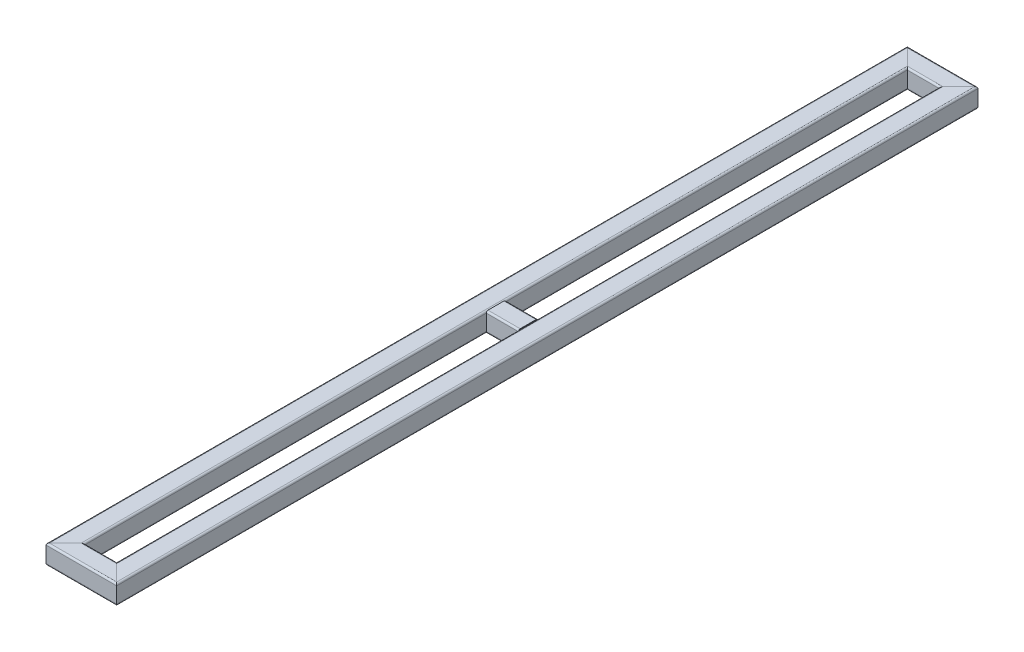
ISO-10303-21;
HEADER;
FILE_DESCRIPTION(('STEP AP214'),'2;1');
FILE_NAME('part.step','',(''),(''),'','','');
FILE_SCHEMA(('AUTOMOTIVE_DESIGN { 1 0 10303 214 1 1 1 1 }'));
ENDSEC;
DATA;
#1=APPLICATION_CONTEXT('core data for automotive mechanical design processes');
#2=APPLICATION_PROTOCOL_DEFINITION('international standard','automotive_design',2000,#1);
#3=PRODUCT_CONTEXT('',#1,'mechanical');
#4=PRODUCT('Part','Part','',(#3));
#5=PRODUCT_RELATED_PRODUCT_CATEGORY('part','',(#4));
#6=PRODUCT_DEFINITION_FORMATION('','',#4);
#7=PRODUCT_DEFINITION_CONTEXT('part definition',#1,'design');
#8=PRODUCT_DEFINITION('design','',#6,#7);
#9=PRODUCT_DEFINITION_SHAPE('','',#8);
#10=(LENGTH_UNIT() NAMED_UNIT(*) SI_UNIT(.MILLI.,.METRE.));
#11=(NAMED_UNIT(*) PLANE_ANGLE_UNIT() SI_UNIT($,.RADIAN.));
#12=(NAMED_UNIT(*) SI_UNIT($,.STERADIAN.) SOLID_ANGLE_UNIT());
#13=UNCERTAINTY_MEASURE_WITH_UNIT(LENGTH_MEASURE(1.E-05),#10,'distance_accuracy_value','');
#14=(GEOMETRIC_REPRESENTATION_CONTEXT(3) GLOBAL_UNCERTAINTY_ASSIGNED_CONTEXT((#13)) GLOBAL_UNIT_ASSIGNED_CONTEXT((#10,
#11,#12)) REPRESENTATION_CONTEXT('',''));
#15=CARTESIAN_POINT('',(0.,0.,0.));
#16=DIRECTION('',(0.,0.,1.));
#17=DIRECTION('',(1.,0.,0.));
#18=AXIS2_PLACEMENT_3D('',#15,#16,#17);
#19=CARTESIAN_POINT('',(18.5,18.5,0.));
#20=DIRECTION('',(0.,0.,-1.));
#21=DIRECTION('',(0.,1.,0.));
#22=AXIS2_PLACEMENT_3D('',#19,#20,#21);
#23=CYLINDRICAL_SURFACE('',#22,4.);
#24=CARTESIAN_POINT('',(18.5,18.5000000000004,-1946.5));
#25=DIRECTION('',(0.707106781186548,0.,-0.707106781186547));
#26=DIRECTION('',(-0.707106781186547,0.,-0.707106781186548));
#27=AXIS2_PLACEMENT_3D('',#24,#25,#26);
#28=ELLIPSE('',#27,5.65685424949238,4.);
#29=CARTESIAN_POINT('',(18.5,22.5000000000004,-1946.5));
#30=VERTEX_POINT('',#29);
#31=CARTESIAN_POINT('',(22.5,18.5000000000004,-1942.5));
#32=VERTEX_POINT('',#31);
#33=EDGE_CURVE('E215',#30,#32,#28,.T.);
#34=ORIENTED_EDGE('',*,*,#33,.F.);
#35=DIRECTION('',(0.,0.,-1.));
#36=VECTOR('',#35,1.);
#37=CARTESIAN_POINT('',(18.5,22.5,0.));
#38=LINE('',#37,#36);
#39=CARTESIAN_POINT('',(18.5,22.5,-18.5));
#40=VERTEX_POINT('',#39);
#41=EDGE_CURVE('E295',#40,#30,#38,.T.);
#42=ORIENTED_EDGE('',*,*,#41,.F.);
#43=CARTESIAN_POINT('',(18.5,18.5,-18.5));
#44=DIRECTION('',(0.707106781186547,0.,0.707106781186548));
#45=DIRECTION('',(0.707106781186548,0.,-0.707106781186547));
#46=AXIS2_PLACEMENT_3D('',#43,#44,#45);
#47=ELLIPSE('',#46,5.65685424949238,4.);
#48=CARTESIAN_POINT('',(22.5,18.5000000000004,-22.5));
#49=VERTEX_POINT('',#48);
#50=EDGE_CURVE('E206',#49,#40,#47,.T.);
#51=ORIENTED_EDGE('',*,*,#50,.F.);
#52=DIRECTION('',(0.,0.,-1.));
#53=VECTOR('',#52,1.);
#54=CARTESIAN_POINT('',(22.5,18.5,0.));
#55=LINE('',#54,#53);
#56=EDGE_CURVE('E75',#49,#32,#55,.T.);
#57=ORIENTED_EDGE('',*,*,#56,.T.);
#58=EDGE_LOOP('',(#34,#42,#51,#57));
#59=FACE_BOUND('',#58,.T.);
#60=ADVANCED_FACE('F71',(#59),#23,.T.);
#61=CARTESIAN_POINT('',(18.5,22.5,0.));
#62=DIRECTION('',(0.,-1.,0.));
#63=DIRECTION('',(0.,0.,-1.));
#64=AXIS2_PLACEMENT_3D('',#61,#62,#63);
#65=PLANE('',#64);
#66=DIRECTION('',(0.707106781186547,0.,0.707106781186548));
#67=VECTOR('',#66,1.);
#68=CARTESIAN_POINT('',(991.75,22.5000000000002,-973.25));
#69=LINE('',#68,#67);
#70=CARTESIAN_POINT('',(-18.5,22.5000000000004,-1983.5));
#71=VERTEX_POINT('',#70);
#72=EDGE_CURVE('E212',#71,#30,#69,.T.);
#73=ORIENTED_EDGE('',*,*,#72,.F.);
#74=DIRECTION('',(0.,0.,-1.));
#75=VECTOR('',#74,1.);
#76=CARTESIAN_POINT('',(-18.5,22.5,0.));
#77=LINE('',#76,#75);
#78=CARTESIAN_POINT('',(-18.5,22.5,18.5));
#79=VERTEX_POINT('',#78);
#80=EDGE_CURVE('E293',#79,#71,#77,.T.);
#81=ORIENTED_EDGE('',*,*,#80,.F.);
#82=DIRECTION('',(-0.707106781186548,0.,0.707106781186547));
#83=VECTOR('',#82,1.);
#84=CARTESIAN_POINT('',(9.25000000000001,22.5,-9.25000000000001));
#85=LINE('',#84,#83);
#86=EDGE_CURVE('E311',#40,#79,#85,.T.);
#87=ORIENTED_EDGE('',*,*,#86,.F.);
#88=ORIENTED_EDGE('',*,*,#41,.T.);
#89=EDGE_LOOP('',(#73,#81,#87,#88));
#90=FACE_BOUND('',#89,.T.);
#91=ADVANCED_FACE('F302',(#90),#65,.F.);
#92=CARTESIAN_POINT('',(-18.5,18.5,0.));
#93=DIRECTION('',(0.,0.,-1.));
#94=DIRECTION('',(0.,1.,0.));
#95=AXIS2_PLACEMENT_3D('',#92,#93,#94);
#96=CYLINDRICAL_SURFACE('',#95,4.);
#97=CARTESIAN_POINT('',(-18.5,18.5000000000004,-1983.5));
#98=DIRECTION('',(0.707106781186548,0.,-0.707106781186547));
#99=DIRECTION('',(-0.707106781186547,0.,-0.707106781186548));
#100=AXIS2_PLACEMENT_3D('',#97,#98,#99);
#101=ELLIPSE('',#100,5.65685424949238,4.);
#102=CARTESIAN_POINT('',(-22.5,18.5000000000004,-1987.5));
#103=VERTEX_POINT('',#102);
#104=EDGE_CURVE('E13',#103,#71,#101,.T.);
#105=ORIENTED_EDGE('',*,*,#104,.F.);
#106=DIRECTION('',(0.,0.,-1.));
#107=VECTOR('',#106,1.);
#108=CARTESIAN_POINT('',(-22.5,18.5,0.));
#109=LINE('',#108,#107);
#110=CARTESIAN_POINT('',(-22.5,18.5,22.5));
#111=VERTEX_POINT('',#110);
#112=EDGE_CURVE('E290',#111,#103,#109,.T.);
#113=ORIENTED_EDGE('',*,*,#112,.F.);
#114=CARTESIAN_POINT('',(-18.5,18.5,18.5));
#115=DIRECTION('',(0.707106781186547,0.,0.707106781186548));
#116=DIRECTION('',(0.707106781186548,0.,-0.707106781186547));
#117=AXIS2_PLACEMENT_3D('',#114,#115,#116);
#118=ELLIPSE('',#117,5.65685424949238,4.);
#119=EDGE_CURVE('E308',#79,#111,#118,.T.);
#120=ORIENTED_EDGE('',*,*,#119,.F.);
#121=ORIENTED_EDGE('',*,*,#80,.T.);
#122=EDGE_LOOP('',(#105,#113,#120,#121));
#123=FACE_BOUND('',#122,.T.);
#124=ADVANCED_FACE('F305',(#123),#96,.T.);
#125=CARTESIAN_POINT('',(-22.5,-18.5,0.));
#126=DIRECTION('',(1.,0.,0.));
#127=DIRECTION('',(0.,0.,-1.));
#128=AXIS2_PLACEMENT_3D('',#125,#126,#127);
#129=PLANE('',#128);
#130=DIRECTION('',(0.,1.,0.));
#131=VECTOR('',#130,1.);
#132=CARTESIAN_POINT('',(-22.5,-18.5000000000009,-1987.5));
#133=LINE('',#132,#131);
#134=CARTESIAN_POINT('',(-22.5,-18.4999999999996,-1987.5));
#135=VERTEX_POINT('',#134);
#136=EDGE_CURVE('E81',#135,#103,#133,.T.);
#137=ORIENTED_EDGE('',*,*,#136,.F.);
#138=DIRECTION('',(0.,0.,-1.));
#139=VECTOR('',#138,1.);
#140=CARTESIAN_POINT('',(-22.5,-18.5,0.));
#141=LINE('',#140,#139);
#142=CARTESIAN_POINT('',(-22.5,-18.5,22.5));
#143=VERTEX_POINT('',#142);
#144=EDGE_CURVE('E287',#143,#135,#141,.T.);
#145=ORIENTED_EDGE('',*,*,#144,.F.);
#146=DIRECTION('',(0.,-1.,0.));
#147=VECTOR('',#146,1.);
#148=CARTESIAN_POINT('',(-22.5,-18.5,22.5));
#149=LINE('',#148,#147);
#150=EDGE_CURVE('E310',#111,#143,#149,.T.);
#151=ORIENTED_EDGE('',*,*,#150,.F.);
#152=ORIENTED_EDGE('',*,*,#112,.T.);
#153=EDGE_LOOP('',(#137,#145,#151,#152));
#154=FACE_BOUND('',#153,.T.);
#155=ADVANCED_FACE('F321',(#154),#129,.F.);
#156=CARTESIAN_POINT('',(-18.5,-18.5,0.));
#157=DIRECTION('',(0.,0.,-1.));
#158=DIRECTION('',(0.,1.,0.));
#159=AXIS2_PLACEMENT_3D('',#156,#157,#158);
#160=CYLINDRICAL_SURFACE('',#159,4.);
#161=CARTESIAN_POINT('',(-18.5,-18.4999999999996,-1983.5));
#162=DIRECTION('',(0.707106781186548,0.,-0.707106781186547));
#163=DIRECTION('',(-0.707106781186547,0.,-0.707106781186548));
#164=AXIS2_PLACEMENT_3D('',#161,#162,#163);
#165=ELLIPSE('',#164,5.65685424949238,4.);
#166=CARTESIAN_POINT('',(-18.5000000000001,-22.4999999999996,-1983.5));
#167=VERTEX_POINT('',#166);
#168=EDGE_CURVE('E230',#167,#135,#165,.T.);
#169=ORIENTED_EDGE('',*,*,#168,.F.);
#170=DIRECTION('',(0.,0.,-1.));
#171=VECTOR('',#170,1.);
#172=CARTESIAN_POINT('',(-18.5,-22.5,0.));
#173=LINE('',#172,#171);
#174=CARTESIAN_POINT('',(-18.5,-22.5,18.5));
#175=VERTEX_POINT('',#174);
#176=EDGE_CURVE('E284',#175,#167,#173,.T.);
#177=ORIENTED_EDGE('',*,*,#176,.F.);
#178=CARTESIAN_POINT('',(-18.5,-18.5,18.5));
#179=DIRECTION('',(0.707106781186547,0.,0.707106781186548));
#180=DIRECTION('',(0.707106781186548,0.,-0.707106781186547));
#181=AXIS2_PLACEMENT_3D('',#178,#179,#180);
#182=ELLIPSE('',#181,5.65685424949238,4.);
#183=EDGE_CURVE('E217',#143,#175,#182,.T.);
#184=ORIENTED_EDGE('',*,*,#183,.F.);
#185=ORIENTED_EDGE('',*,*,#144,.T.);
#186=EDGE_LOOP('',(#169,#177,#184,#185));
#187=FACE_BOUND('',#186,.T.);
#188=ADVANCED_FACE('F319',(#187),#160,.T.);
#189=CARTESIAN_POINT('',(-18.5,-22.5,0.));
#190=DIRECTION('',(0.,1.,0.));
#191=DIRECTION('',(0.,0.,1.));
#192=AXIS2_PLACEMENT_3D('',#189,#190,#191);
#193=PLANE('',#192);
#194=DIRECTION('',(-0.707106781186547,0.,-0.707106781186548));
#195=VECTOR('',#194,1.);
#196=CARTESIAN_POINT('',(973.25,-22.4999999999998,-991.75));
#197=LINE('',#196,#195);
#198=CARTESIAN_POINT('',(18.5,-22.4999999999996,-1946.5));
#199=VERTEX_POINT('',#198);
#200=EDGE_CURVE('E233',#199,#167,#197,.T.);
#201=ORIENTED_EDGE('',*,*,#200,.F.);
#202=DIRECTION('',(0.,0.,-1.));
#203=VECTOR('',#202,1.);
#204=CARTESIAN_POINT('',(18.5,-22.5,0.));
#205=LINE('',#204,#203);
#206=CARTESIAN_POINT('',(18.5,-22.5,-18.5));
#207=VERTEX_POINT('',#206);
#208=EDGE_CURVE('E282',#207,#199,#205,.T.);
#209=ORIENTED_EDGE('',*,*,#208,.F.);
#210=DIRECTION('',(0.707106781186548,0.,-0.707106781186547));
#211=VECTOR('',#210,1.);
#212=CARTESIAN_POINT('',(-9.25000000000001,-22.5,9.25000000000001));
#213=LINE('',#212,#211);
#214=EDGE_CURVE('E211',#175,#207,#213,.T.);
#215=ORIENTED_EDGE('',*,*,#214,.F.);
#216=ORIENTED_EDGE('',*,*,#176,.T.);
#217=EDGE_LOOP('',(#201,#209,#215,#216));
#218=FACE_BOUND('',#217,.T.);
#219=ADVANCED_FACE('F323',(#218),#193,.F.);
#220=CARTESIAN_POINT('',(18.5,-18.5,0.));
#221=DIRECTION('',(0.,0.,-1.));
#222=DIRECTION('',(0.,1.,0.));
#223=AXIS2_PLACEMENT_3D('',#220,#221,#222);
#224=CYLINDRICAL_SURFACE('',#223,4.);
#225=CARTESIAN_POINT('',(18.5,-18.4999999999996,-1946.5));
#226=DIRECTION('',(0.707106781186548,0.,-0.707106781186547));
#227=DIRECTION('',(-0.707106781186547,0.,-0.707106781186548));
#228=AXIS2_PLACEMENT_3D('',#225,#226,#227);
#229=ELLIPSE('',#228,5.65685424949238,4.);
#230=CARTESIAN_POINT('',(22.5,-18.5000000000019,-1942.5));
#231=VERTEX_POINT('',#230);
#232=EDGE_CURVE('E194',#231,#199,#229,.T.);
#233=ORIENTED_EDGE('',*,*,#232,.F.);
#234=DIRECTION('',(0.,0.,-1.));
#235=VECTOR('',#234,1.);
#236=CARTESIAN_POINT('',(22.5,-18.5,0.));
#237=LINE('',#236,#235);
#238=CARTESIAN_POINT('',(22.5,-18.5,-22.5));
#239=VERTEX_POINT('',#238);
#240=EDGE_CURVE('E186',#239,#231,#237,.T.);
#241=ORIENTED_EDGE('',*,*,#240,.F.);
#242=CARTESIAN_POINT('',(18.5,-18.5,-18.5));
#243=DIRECTION('',(0.707106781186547,0.,0.707106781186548));
#244=DIRECTION('',(0.707106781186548,0.,-0.707106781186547));
#245=AXIS2_PLACEMENT_3D('',#242,#243,#244);
#246=ELLIPSE('',#245,5.65685424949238,4.);
#247=EDGE_CURVE('E191',#207,#239,#246,.T.);
#248=ORIENTED_EDGE('',*,*,#247,.F.);
#249=ORIENTED_EDGE('',*,*,#208,.T.);
#250=EDGE_LOOP('',(#233,#241,#248,#249));
#251=FACE_BOUND('',#250,.T.);
#252=ADVANCED_FACE('F188',(#251),#224,.T.);
#253=CARTESIAN_POINT('',(-18.5,18.5,0.));
#254=DIRECTION('',(0.,0.,-1.));
#255=DIRECTION('',(0.,1.,0.));
#256=AXIS2_PLACEMENT_3D('',#253,#254,#255);
#257=CYLINDRICAL_SURFACE('',#256,1.99999999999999);
#258=DIRECTION('',(0.,0.,-1.));
#259=VECTOR('',#258,1.);
#260=CARTESIAN_POINT('',(-20.5,18.5,0.));
#261=LINE('',#260,#259);
#262=CARTESIAN_POINT('',(-20.5,18.5000000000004,20.5));
#263=VERTEX_POINT('',#262);
#264=CARTESIAN_POINT('',(-20.5,18.5000000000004,-1985.5));
#265=VERTEX_POINT('',#264);
#266=EDGE_CURVE('E239',#263,#265,#261,.T.);
#267=ORIENTED_EDGE('',*,*,#266,.T.);
#268=CARTESIAN_POINT('',(-18.5,18.5000000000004,-1983.5));
#269=DIRECTION('',(0.707106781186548,0.,-0.707106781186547));
#270=DIRECTION('',(-0.707106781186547,0.,-0.707106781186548));
#271=AXIS2_PLACEMENT_3D('',#268,#269,#270);
#272=ELLIPSE('',#271,2.82842712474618,1.99999999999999);
#273=CARTESIAN_POINT('',(-18.4999999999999,20.5000000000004,-1983.5));
#274=VERTEX_POINT('',#273);
#275=EDGE_CURVE('E117',#265,#274,#272,.T.);
#276=ORIENTED_EDGE('',*,*,#275,.T.);
#277=DIRECTION('',(0.,0.,-1.));
#278=VECTOR('',#277,1.);
#279=CARTESIAN_POINT('',(-18.5,20.5,0.));
#280=LINE('',#279,#278);
#281=CARTESIAN_POINT('',(-18.5,20.5,18.5));
#282=VERTEX_POINT('',#281);
#283=EDGE_CURVE('E242',#282,#274,#280,.T.);
#284=ORIENTED_EDGE('',*,*,#283,.F.);
#285=CARTESIAN_POINT('',(-18.5,18.5,18.5));
#286=DIRECTION('',(0.707106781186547,0.,0.707106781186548));
#287=DIRECTION('',(0.707106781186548,0.,-0.707106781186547));
#288=AXIS2_PLACEMENT_3D('',#285,#286,#287);
#289=ELLIPSE('',#288,2.82842712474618,1.99999999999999);
#290=EDGE_CURVE('E238',#282,#263,#289,.T.);
#291=ORIENTED_EDGE('',*,*,#290,.T.);
#292=EDGE_LOOP('',(#267,#276,#284,#291));
#293=FACE_BOUND('',#292,.T.);
#294=ADVANCED_FACE('F330',(#293),#257,.F.);
#295=CARTESIAN_POINT('',(18.5,20.5,0.));
#296=DIRECTION('',(0.,-1.,0.));
#297=DIRECTION('',(0.,0.,-1.));
#298=AXIS2_PLACEMENT_3D('',#295,#296,#297);
#299=PLANE('',#298);
#300=ORIENTED_EDGE('',*,*,#283,.T.);
#301=DIRECTION('',(0.707106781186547,0.,0.707106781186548));
#302=VECTOR('',#301,1.);
#303=CARTESIAN_POINT('',(991.75,20.5000000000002,-973.25));
#304=LINE('',#303,#302);
#305=CARTESIAN_POINT('',(18.5,20.5000000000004,-1946.5));
#306=VERTEX_POINT('',#305);
#307=EDGE_CURVE('E90',#274,#306,#304,.T.);
#308=ORIENTED_EDGE('',*,*,#307,.T.);
#309=DIRECTION('',(0.,0.,-1.));
#310=VECTOR('',#309,1.);
#311=CARTESIAN_POINT('',(18.5,20.5,0.));
#312=LINE('',#311,#310);
#313=CARTESIAN_POINT('',(18.5,20.5,-18.5));
#314=VERTEX_POINT('',#313);
#315=EDGE_CURVE('E247',#314,#306,#312,.T.);
#316=ORIENTED_EDGE('',*,*,#315,.F.);
#317=DIRECTION('',(-0.707106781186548,0.,0.707106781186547));
#318=VECTOR('',#317,1.);
#319=CARTESIAN_POINT('',(9.25,20.5,-9.25));
#320=LINE('',#319,#318);
#321=EDGE_CURVE('E241',#314,#282,#320,.T.);
#322=ORIENTED_EDGE('',*,*,#321,.T.);
#323=EDGE_LOOP('',(#300,#308,#316,#322));
#324=FACE_BOUND('',#323,.T.);
#325=ADVANCED_FACE('F372',(#324),#299,.T.);
#326=CARTESIAN_POINT('',(18.5,18.5,0.));
#327=DIRECTION('',(0.,0.,-1.));
#328=DIRECTION('',(0.,1.,0.));
#329=AXIS2_PLACEMENT_3D('',#326,#327,#328);
#330=CYLINDRICAL_SURFACE('',#329,1.99999999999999);
#331=ORIENTED_EDGE('',*,*,#315,.T.);
#332=CARTESIAN_POINT('',(18.5,18.5000000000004,-1946.5));
#333=DIRECTION('',(0.707106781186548,0.,-0.707106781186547));
#334=DIRECTION('',(-0.707106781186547,0.,-0.707106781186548));
#335=AXIS2_PLACEMENT_3D('',#332,#333,#334);
#336=ELLIPSE('',#335,2.82842712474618,1.99999999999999);
#337=CARTESIAN_POINT('',(20.5,18.5000000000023,-1944.5));
#338=VERTEX_POINT('',#337);
#339=EDGE_CURVE('E243',#306,#338,#336,.T.);
#340=ORIENTED_EDGE('',*,*,#339,.T.);
#341=DIRECTION('',(0.,0.,-1.));
#342=VECTOR('',#341,1.);
#343=CARTESIAN_POINT('',(20.5,18.5,0.));
#344=LINE('',#343,#342);
#345=CARTESIAN_POINT('',(20.5,18.5000000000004,-20.5));
#346=VERTEX_POINT('',#345);
#347=EDGE_CURVE('E252',#346,#338,#344,.T.);
#348=ORIENTED_EDGE('',*,*,#347,.F.);
#349=CARTESIAN_POINT('',(18.5,18.5,-18.5));
#350=DIRECTION('',(0.707106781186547,0.,0.707106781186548));
#351=DIRECTION('',(0.707106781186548,0.,-0.707106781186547));
#352=AXIS2_PLACEMENT_3D('',#349,#350,#351);
#353=ELLIPSE('',#352,2.82842712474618,1.99999999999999);
#354=EDGE_CURVE('E246',#346,#314,#353,.T.);
#355=ORIENTED_EDGE('',*,*,#354,.T.);
#356=EDGE_LOOP('',(#331,#340,#348,#355));
#357=FACE_BOUND('',#356,.T.);
#358=ADVANCED_FACE('F383',(#357),#330,.F.);
#359=CARTESIAN_POINT('',(20.5,18.5,0.));
#360=DIRECTION('',(-1.,0.,0.));
#361=DIRECTION('',(0.,0.,1.));
#362=AXIS2_PLACEMENT_3D('',#359,#360,#361);
#363=PLANE('',#362);
#364=ORIENTED_EDGE('',*,*,#347,.T.);
#365=DIRECTION('',(0.,-1.,0.));
#366=VECTOR('',#365,1.);
#367=CARTESIAN_POINT('',(20.5,18.4999999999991,-1944.5));
#368=LINE('',#367,#366);
#369=CARTESIAN_POINT('',(20.5,-18.4999999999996,-1944.5));
#370=VERTEX_POINT('',#369);
#371=EDGE_CURVE('E248',#338,#370,#368,.T.);
#372=ORIENTED_EDGE('',*,*,#371,.T.);
#373=DIRECTION('',(0.,0.,-1.));
#374=VECTOR('',#373,1.);
#375=CARTESIAN_POINT('',(20.5,-18.5,0.));
#376=LINE('',#375,#374);
#377=CARTESIAN_POINT('',(20.5,-18.5,-20.5));
#378=VERTEX_POINT('',#377);
#379=EDGE_CURVE('E257',#378,#370,#376,.T.);
#380=ORIENTED_EDGE('',*,*,#379,.F.);
#381=DIRECTION('',(0.,1.,0.));
#382=VECTOR('',#381,1.);
#383=CARTESIAN_POINT('',(20.5,18.5,-20.5));
#384=LINE('',#383,#382);
#385=EDGE_CURVE('E251',#378,#346,#384,.T.);
#386=ORIENTED_EDGE('',*,*,#385,.T.);
#387=EDGE_LOOP('',(#364,#372,#380,#386));
#388=FACE_BOUND('',#387,.T.);
#389=ADVANCED_FACE('F394',(#388),#363,.T.);
#390=CARTESIAN_POINT('',(18.5,-18.5,0.));
#391=DIRECTION('',(0.,0.,-1.));
#392=DIRECTION('',(0.,1.,0.));
#393=AXIS2_PLACEMENT_3D('',#390,#391,#392);
#394=CYLINDRICAL_SURFACE('',#393,2.);
#395=ORIENTED_EDGE('',*,*,#379,.T.);
#396=CARTESIAN_POINT('',(18.5,-18.4999999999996,-1946.5));
#397=DIRECTION('',(0.707106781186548,0.,-0.707106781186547));
#398=DIRECTION('',(-0.707106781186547,0.,-0.707106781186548));
#399=AXIS2_PLACEMENT_3D('',#396,#397,#398);
#400=ELLIPSE('',#399,2.82842712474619,2.);
#401=CARTESIAN_POINT('',(18.5,-20.4999999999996,-1946.5));
#402=VERTEX_POINT('',#401);
#403=EDGE_CURVE('E253',#370,#402,#400,.T.);
#404=ORIENTED_EDGE('',*,*,#403,.T.);
#405=DIRECTION('',(0.,0.,-1.));
#406=VECTOR('',#405,1.);
#407=CARTESIAN_POINT('',(18.5,-20.5,0.));
#408=LINE('',#407,#406);
#409=CARTESIAN_POINT('',(18.5,-20.5,-18.5));
#410=VERTEX_POINT('',#409);
#411=EDGE_CURVE('E262',#410,#402,#408,.T.);
#412=ORIENTED_EDGE('',*,*,#411,.F.);
#413=CARTESIAN_POINT('',(18.5,-18.5,-18.5));
#414=DIRECTION('',(0.707106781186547,0.,0.707106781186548));
#415=DIRECTION('',(0.707106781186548,0.,-0.707106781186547));
#416=AXIS2_PLACEMENT_3D('',#413,#414,#415);
#417=ELLIPSE('',#416,2.82842712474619,2.);
#418=EDGE_CURVE('E256',#410,#378,#417,.T.);
#419=ORIENTED_EDGE('',*,*,#418,.T.);
#420=EDGE_LOOP('',(#395,#404,#412,#419));
#421=FACE_BOUND('',#420,.T.);
#422=ADVANCED_FACE('F405',(#421),#394,.F.);
#423=CARTESIAN_POINT('',(-18.5,-20.5,0.));
#424=DIRECTION('',(0.,1.,0.));
#425=DIRECTION('',(0.,0.,1.));
#426=AXIS2_PLACEMENT_3D('',#423,#424,#425);
#427=PLANE('',#426);
#428=ORIENTED_EDGE('',*,*,#411,.T.);
#429=DIRECTION('',(-0.707106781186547,0.,-0.707106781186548));
#430=VECTOR('',#429,1.);
#431=CARTESIAN_POINT('',(973.25,-20.4999999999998,-991.75));
#432=LINE('',#431,#430);
#433=CARTESIAN_POINT('',(-18.5,-20.4999999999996,-1983.5));
#434=VERTEX_POINT('',#433);
#435=EDGE_CURVE('E258',#402,#434,#432,.T.);
#436=ORIENTED_EDGE('',*,*,#435,.T.);
#437=DIRECTION('',(0.,0.,-1.));
#438=VECTOR('',#437,1.);
#439=CARTESIAN_POINT('',(-18.5,-20.5,0.));
#440=LINE('',#439,#438);
#441=CARTESIAN_POINT('',(-18.5,-20.5,18.5));
#442=VERTEX_POINT('',#441);
#443=EDGE_CURVE('E266',#442,#434,#440,.T.);
#444=ORIENTED_EDGE('',*,*,#443,.F.);
#445=DIRECTION('',(0.707106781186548,0.,-0.707106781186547));
#446=VECTOR('',#445,1.);
#447=CARTESIAN_POINT('',(-9.25,-20.5,9.25));
#448=LINE('',#447,#446);
#449=EDGE_CURVE('E261',#442,#410,#448,.T.);
#450=ORIENTED_EDGE('',*,*,#449,.T.);
#451=EDGE_LOOP('',(#428,#436,#444,#450));
#452=FACE_BOUND('',#451,.T.);
#453=ADVANCED_FACE('F416',(#452),#427,.T.);
#454=CARTESIAN_POINT('',(-18.5,-18.5,0.));
#455=DIRECTION('',(0.,0.,-1.));
#456=DIRECTION('',(0.,1.,0.));
#457=AXIS2_PLACEMENT_3D('',#454,#455,#456);
#458=CYLINDRICAL_SURFACE('',#457,2.);
#459=ORIENTED_EDGE('',*,*,#443,.T.);
#460=CARTESIAN_POINT('',(-18.5,-18.4999999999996,-1983.5));
#461=DIRECTION('',(0.707106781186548,0.,-0.707106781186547));
#462=DIRECTION('',(-0.707106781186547,0.,-0.707106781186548));
#463=AXIS2_PLACEMENT_3D('',#460,#461,#462);
#464=ELLIPSE('',#463,2.82842712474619,2.);
#465=CARTESIAN_POINT('',(-20.5,-18.5000000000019,-1985.5));
#466=VERTEX_POINT('',#465);
#467=EDGE_CURVE('E263',#434,#466,#464,.T.);
#468=ORIENTED_EDGE('',*,*,#467,.T.);
#469=DIRECTION('',(0.,0.,-1.));
#470=VECTOR('',#469,1.);
#471=CARTESIAN_POINT('',(-20.5,-18.5,0.));
#472=LINE('',#471,#470);
#473=CARTESIAN_POINT('',(-20.5,-18.5,20.5));
#474=VERTEX_POINT('',#473);
#475=EDGE_CURVE('E224',#474,#466,#472,.T.);
#476=ORIENTED_EDGE('',*,*,#475,.F.);
#477=CARTESIAN_POINT('',(-18.5,-18.5,18.5));
#478=DIRECTION('',(0.707106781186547,0.,0.707106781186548));
#479=DIRECTION('',(0.707106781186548,0.,-0.707106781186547));
#480=AXIS2_PLACEMENT_3D('',#477,#478,#479);
#481=ELLIPSE('',#480,2.82842712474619,2.);
#482=EDGE_CURVE('E265',#474,#442,#481,.T.);
#483=ORIENTED_EDGE('',*,*,#482,.T.);
#484=EDGE_LOOP('',(#459,#468,#476,#483));
#485=FACE_BOUND('',#484,.T.);
#486=ADVANCED_FACE('F427',(#485),#458,.F.);
#487=CARTESIAN_POINT('',(-20.5,-18.5,0.));
#488=DIRECTION('',(1.,0.,0.));
#489=DIRECTION('',(0.,0.,-1.));
#490=AXIS2_PLACEMENT_3D('',#487,#488,#489);
#491=PLANE('',#490);
#492=ORIENTED_EDGE('',*,*,#475,.T.);
#493=DIRECTION('',(0.,1.,0.));
#494=VECTOR('',#493,1.);
#495=CARTESIAN_POINT('',(-20.5,-18.5000000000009,-1985.5));
#496=LINE('',#495,#494);
#497=EDGE_CURVE('E112',#466,#265,#496,.T.);
#498=ORIENTED_EDGE('',*,*,#497,.T.);
#499=ORIENTED_EDGE('',*,*,#266,.F.);
#500=DIRECTION('',(0.,-1.,0.));
#501=VECTOR('',#500,1.);
#502=CARTESIAN_POINT('',(-20.5,-18.5,20.5));
#503=LINE('',#502,#501);
#504=EDGE_CURVE('E199',#263,#474,#503,.T.);
#505=ORIENTED_EDGE('',*,*,#504,.T.);
#506=EDGE_LOOP('',(#492,#498,#499,#505));
#507=FACE_BOUND('',#506,.T.);
#508=ADVANCED_FACE('F438',(#507),#491,.T.);
#509=CARTESIAN_POINT('',(22.5,18.5,0.));
#510=DIRECTION('',(-1.,0.,0.));
#511=DIRECTION('',(0.,0.,1.));
#512=AXIS2_PLACEMENT_3D('',#509,#510,#511);
#513=PLANE('',#512);
#514=DIRECTION('',(0.,-1.,0.));
#515=VECTOR('',#514,1.);
#516=CARTESIAN_POINT('',(22.5,18.4999999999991,-1942.5));
#517=LINE('',#516,#515);
#518=EDGE_CURVE('E226',#32,#231,#517,.T.);
#519=ORIENTED_EDGE('',*,*,#518,.F.);
#520=ORIENTED_EDGE('',*,*,#56,.F.);
#521=DIRECTION('',(0.,1.,0.));
#522=VECTOR('',#521,1.);
#523=CARTESIAN_POINT('',(22.5,18.5,-22.5));
#524=LINE('',#523,#522);
#525=EDGE_CURVE('E198',#239,#49,#524,.T.);
#526=ORIENTED_EDGE('',*,*,#525,.F.);
#527=ORIENTED_EDGE('',*,*,#240,.T.);
#528=EDGE_LOOP('',(#519,#520,#526,#527));
#529=FACE_BOUND('',#528,.T.);
#530=ADVANCED_FACE('F202',(#529),#513,.F.);
#531=CARTESIAN_POINT('',(0.,0.,0.));
#532=DIRECTION('',(0.707106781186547,0.,0.707106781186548));
#533=DIRECTION('',(0.707106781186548,0.,-0.707106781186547));
#534=AXIS2_PLACEMENT_3D('',#531,#532,#533);
#535=PLANE('',#534);
#536=ORIENTED_EDGE('',*,*,#290,.F.);
#537=ORIENTED_EDGE('',*,*,#321,.F.);
#538=ORIENTED_EDGE('',*,*,#354,.F.);
#539=ORIENTED_EDGE('',*,*,#385,.F.);
#540=ORIENTED_EDGE('',*,*,#418,.F.);
#541=ORIENTED_EDGE('',*,*,#449,.F.);
#542=ORIENTED_EDGE('',*,*,#482,.F.);
#543=ORIENTED_EDGE('',*,*,#504,.F.);
#544=EDGE_LOOP('',(#536,#537,#538,#539,#540,#541,#542,#543));
#545=FACE_BOUND('',#544,.T.);
#546=ORIENTED_EDGE('',*,*,#525,.T.);
#547=ORIENTED_EDGE('',*,*,#50,.T.);
#548=ORIENTED_EDGE('',*,*,#86,.T.);
#549=ORIENTED_EDGE('',*,*,#119,.T.);
#550=ORIENTED_EDGE('',*,*,#150,.T.);
#551=ORIENTED_EDGE('',*,*,#183,.T.);
#552=ORIENTED_EDGE('',*,*,#214,.T.);
#553=ORIENTED_EDGE('',*,*,#247,.T.);
#554=EDGE_LOOP('',(#546,#547,#548,#549,#550,#551,#552,#553));
#555=FACE_BOUND('',#554,.T.);
#556=ADVANCED_FACE('F209',(#545,#555),#535,.T.);
#557=CARTESIAN_POINT('',(0.,3.7378978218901E-13,-1965.));
#558=DIRECTION('',(0.707106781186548,0.,-0.707106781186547));
#559=DIRECTION('',(-0.707106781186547,0.,-0.707106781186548));
#560=AXIS2_PLACEMENT_3D('',#557,#558,#559);
#561=PLANE('',#560);
#562=ORIENTED_EDGE('',*,*,#275,.F.);
#563=ORIENTED_EDGE('',*,*,#497,.F.);
#564=ORIENTED_EDGE('',*,*,#467,.F.);
#565=ORIENTED_EDGE('',*,*,#435,.F.);
#566=ORIENTED_EDGE('',*,*,#403,.F.);
#567=ORIENTED_EDGE('',*,*,#371,.F.);
#568=ORIENTED_EDGE('',*,*,#339,.F.);
#569=ORIENTED_EDGE('',*,*,#307,.F.);
#570=EDGE_LOOP('',(#562,#563,#564,#565,#566,#567,#568,#569));
#571=FACE_BOUND('',#570,.T.);
#572=ORIENTED_EDGE('',*,*,#72,.T.);
#573=ORIENTED_EDGE('',*,*,#33,.T.);
#574=ORIENTED_EDGE('',*,*,#518,.T.);
#575=ORIENTED_EDGE('',*,*,#232,.T.);
#576=ORIENTED_EDGE('',*,*,#200,.T.);
#577=ORIENTED_EDGE('',*,*,#168,.T.);
#578=ORIENTED_EDGE('',*,*,#136,.T.);
#579=ORIENTED_EDGE('',*,*,#104,.T.);
#580=EDGE_LOOP('',(#572,#573,#574,#575,#576,#577,#578,#579));
#581=FACE_BOUND('',#580,.T.);
#582=ADVANCED_FACE('F73',(#571,#581),#561,.T.);
#583=CLOSED_SHELL('',(#60,#91,#124,#155,#188,#219,#252,#294,#325,#358,#389,#422,#453,#486,#508,
#530,#556,#582));
#584=MANIFOLD_SOLID_BREP('B2',#583);
#585=CARTESIAN_POINT('',(-1.11022302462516E-13,18.5000000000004,-1946.5));
#586=DIRECTION('',(1.,0.,0.));
#587=DIRECTION('',(0.,1.,0.));
#588=AXIS2_PLACEMENT_3D('',#585,#586,#587);
#589=CYLINDRICAL_SURFACE('',#588,4.);
#590=CARTESIAN_POINT('',(18.5,18.5000000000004,-1946.5));
#591=DIRECTION('',(-0.707106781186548,0.,0.707106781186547));
#592=DIRECTION('',(0.707106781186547,0.,0.707106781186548));
#593=AXIS2_PLACEMENT_3D('',#590,#591,#592);
#594=ELLIPSE('',#593,5.65685424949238,4.);
#595=CARTESIAN_POINT('',(22.5,18.5000000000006,-1942.5));
#596=VERTEX_POINT('',#595);
#597=CARTESIAN_POINT('',(18.4999999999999,22.5000000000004,-1946.5));
#598=VERTEX_POINT('',#597);
#599=EDGE_CURVE('E697',#596,#598,#594,.T.);
#600=ORIENTED_EDGE('',*,*,#599,.F.);
#601=DIRECTION('',(1.,0.,0.));
#602=VECTOR('',#601,1.);
#603=CARTESIAN_POINT('',(-1.11022302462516E-13,18.5000000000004,-1942.5));
#604=LINE('',#603,#602);
#605=CARTESIAN_POINT('',(97.5,18.5000000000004,-1942.5));
#606=VERTEX_POINT('',#605);
#607=EDGE_CURVE('E573',#596,#606,#604,.T.);
#608=ORIENTED_EDGE('',*,*,#607,.T.);
#609=CARTESIAN_POINT('',(101.5,18.5000000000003,-1946.5));
#610=DIRECTION('',(0.707106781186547,0.,0.707106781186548));
#611=DIRECTION('',(0.707106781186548,0.,-0.707106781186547));
#612=AXIS2_PLACEMENT_3D('',#609,#610,#611);
#613=ELLIPSE('',#612,5.65685424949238,4.);
#614=CARTESIAN_POINT('',(101.5,22.5000000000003,-1946.5));
#615=VERTEX_POINT('',#614);
#616=EDGE_CURVE('E778',#615,#606,#613,.T.);
#617=ORIENTED_EDGE('',*,*,#616,.F.);
#618=DIRECTION('',(1.,0.,0.));
#619=VECTOR('',#618,1.);
#620=CARTESIAN_POINT('',(-1.11022302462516E-13,22.5000000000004,-1946.5));
#621=LINE('',#620,#619);
#622=EDGE_CURVE('E771',#598,#615,#621,.T.);
#623=ORIENTED_EDGE('',*,*,#622,.F.);
#624=EDGE_LOOP('',(#600,#608,#617,#623));
#625=FACE_BOUND('',#624,.T.);
#626=ADVANCED_FACE('F569',(#625),#589,.T.);
#627=CARTESIAN_POINT('',(-1.11022302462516E-13,22.5000000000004,-1946.5));
#628=DIRECTION('',(0.,-1.,0.));
#629=DIRECTION('',(1.,0.,0.));
#630=AXIS2_PLACEMENT_3D('',#627,#628,#629);
#631=PLANE('',#630);
#632=DIRECTION('',(-0.707106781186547,0.,-0.707106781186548));
#633=VECTOR('',#632,1.);
#634=CARTESIAN_POINT('',(9.24999999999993,22.5000000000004,-1955.75));
#635=LINE('',#634,#633);
#636=CARTESIAN_POINT('',(-18.5000000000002,22.5000000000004,-1983.5));
#637=VERTEX_POINT('',#636);
#638=EDGE_CURVE('E715',#598,#637,#635,.T.);
#639=ORIENTED_EDGE('',*,*,#638,.F.);
#640=ORIENTED_EDGE('',*,*,#622,.T.);
#641=DIRECTION('',(-0.707106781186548,0.,0.707106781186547));
#642=VECTOR('',#641,1.);
#643=CARTESIAN_POINT('',(50.75,22.5000000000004,-1895.75));
#644=LINE('',#643,#642);
#645=CARTESIAN_POINT('',(138.5,22.5000000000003,-1983.5));
#646=VERTEX_POINT('',#645);
#647=EDGE_CURVE('E687',#646,#615,#644,.T.);
#648=ORIENTED_EDGE('',*,*,#647,.F.);
#649=DIRECTION('',(1.,0.,0.));
#650=VECTOR('',#649,1.);
#651=CARTESIAN_POINT('',(-1.11022302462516E-13,22.5000000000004,-1983.5));
#652=LINE('',#651,#650);
#653=EDGE_CURVE('E770',#637,#646,#652,.T.);
#654=ORIENTED_EDGE('',*,*,#653,.F.);
#655=EDGE_LOOP('',(#639,#640,#648,#654));
#656=FACE_BOUND('',#655,.T.);
#657=ADVANCED_FACE('F825',(#656),#631,.F.);
#658=CARTESIAN_POINT('',(-1.11022302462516E-13,18.5000000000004,-1983.5));
#659=DIRECTION('',(1.,0.,0.));
#660=DIRECTION('',(0.,1.,0.));
#661=AXIS2_PLACEMENT_3D('',#658,#659,#660);
#662=CYLINDRICAL_SURFACE('',#661,4.);
#663=CARTESIAN_POINT('',(-18.5000000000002,18.5000000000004,-1983.5));
#664=DIRECTION('',(-0.707106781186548,0.,0.707106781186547));
#665=DIRECTION('',(0.707106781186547,0.,0.707106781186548));
#666=AXIS2_PLACEMENT_3D('',#663,#664,#665);
#667=ELLIPSE('',#666,5.65685424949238,4.);
#668=CARTESIAN_POINT('',(-22.5000000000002,18.5000000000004,-1987.5));
#669=VERTEX_POINT('',#668);
#670=EDGE_CURVE('E712',#637,#669,#667,.T.);
#671=ORIENTED_EDGE('',*,*,#670,.F.);
#672=ORIENTED_EDGE('',*,*,#653,.T.);
#673=CARTESIAN_POINT('',(138.5,18.5000000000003,-1983.5));
#674=DIRECTION('',(0.707106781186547,0.,0.707106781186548));
#675=DIRECTION('',(0.707106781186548,0.,-0.707106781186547));
#676=AXIS2_PLACEMENT_3D('',#673,#674,#675);
#677=ELLIPSE('',#676,5.65685424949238,4.);
#678=CARTESIAN_POINT('',(142.5,18.5000000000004,-1987.5));
#679=VERTEX_POINT('',#678);
#680=EDGE_CURVE('E698',#679,#646,#677,.T.);
#681=ORIENTED_EDGE('',*,*,#680,.F.);
#682=DIRECTION('',(1.,0.,0.));
#683=VECTOR('',#682,1.);
#684=CARTESIAN_POINT('',(-1.11022302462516E-13,18.5000000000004,-1987.5));
#685=LINE('',#684,#683);
#686=EDGE_CURVE('E768',#669,#679,#685,.T.);
#687=ORIENTED_EDGE('',*,*,#686,.F.);
#688=EDGE_LOOP('',(#671,#672,#681,#687));
#689=FACE_BOUND('',#688,.T.);
#690=ADVANCED_FACE('F823',(#689),#662,.T.);
#691=CARTESIAN_POINT('',(-1.11022302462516E-13,-18.4999999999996,-1987.5));
#692=DIRECTION('',(0.,0.,1.));
#693=DIRECTION('',(0.,-1.,0.));
#694=AXIS2_PLACEMENT_3D('',#691,#692,#693);
#695=PLANE('',#694);
#696=DIRECTION('',(0.,-1.,0.));
#697=VECTOR('',#696,1.);
#698=CARTESIAN_POINT('',(-22.5000000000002,-18.4999999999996,-1987.5));
#699=LINE('',#698,#697);
#700=CARTESIAN_POINT('',(-22.5000000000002,-18.4999999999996,-1987.5));
#701=VERTEX_POINT('',#700);
#702=EDGE_CURVE('E707',#669,#701,#699,.T.);
#703=ORIENTED_EDGE('',*,*,#702,.F.);
#704=ORIENTED_EDGE('',*,*,#686,.T.);
#705=DIRECTION('',(0.,1.,0.));
#706=VECTOR('',#705,1.);
#707=CARTESIAN_POINT('',(142.5,-18.4999999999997,-1987.5));
#708=LINE('',#707,#706);
#709=CARTESIAN_POINT('',(142.5,-18.4999999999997,-1987.5));
#710=VERTEX_POINT('',#709);
#711=EDGE_CURVE('E817',#710,#679,#708,.T.);
#712=ORIENTED_EDGE('',*,*,#711,.F.);
#713=DIRECTION('',(1.,0.,0.));
#714=VECTOR('',#713,1.);
#715=CARTESIAN_POINT('',(-1.11022302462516E-13,-18.4999999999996,-1987.5));
#716=LINE('',#715,#714);
#717=EDGE_CURVE('E766',#701,#710,#716,.T.);
#718=ORIENTED_EDGE('',*,*,#717,.F.);
#719=EDGE_LOOP('',(#703,#704,#712,#718));
#720=FACE_BOUND('',#719,.T.);
#721=ADVANCED_FACE('F832',(#720),#695,.F.);
#722=CARTESIAN_POINT('',(-1.11022302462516E-13,-18.4999999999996,-1983.5));
#723=DIRECTION('',(1.,0.,0.));
#724=DIRECTION('',(0.,1.,0.));
#725=AXIS2_PLACEMENT_3D('',#722,#723,#724);
#726=CYLINDRICAL_SURFACE('',#725,4.);
#727=CARTESIAN_POINT('',(-18.5000000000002,-18.4999999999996,-1983.5));
#728=DIRECTION('',(-0.707106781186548,0.,0.707106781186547));
#729=DIRECTION('',(0.707106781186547,0.,0.707106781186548));
#730=AXIS2_PLACEMENT_3D('',#727,#728,#729);
#731=ELLIPSE('',#730,5.65685424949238,4.);
#732=CARTESIAN_POINT('',(-18.5000000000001,-22.4999999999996,-1983.5));
#733=VERTEX_POINT('',#732);
#734=EDGE_CURVE('E703',#701,#733,#731,.T.);
#735=ORIENTED_EDGE('',*,*,#734,.F.);
#736=ORIENTED_EDGE('',*,*,#717,.T.);
#737=CARTESIAN_POINT('',(138.5,-18.4999999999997,-1983.5));
#738=DIRECTION('',(0.707106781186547,0.,0.707106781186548));
#739=DIRECTION('',(0.707106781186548,0.,-0.707106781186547));
#740=AXIS2_PLACEMENT_3D('',#737,#738,#739);
#741=ELLIPSE('',#740,5.65685424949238,4.);
#742=CARTESIAN_POINT('',(138.5,-22.4999999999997,-1983.5));
#743=VERTEX_POINT('',#742);
#744=EDGE_CURVE('E814',#743,#710,#741,.T.);
#745=ORIENTED_EDGE('',*,*,#744,.F.);
#746=DIRECTION('',(1.,0.,0.));
#747=VECTOR('',#746,1.);
#748=CARTESIAN_POINT('',(-1.11022302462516E-13,-22.4999999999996,-1983.5));
#749=LINE('',#748,#747);
#750=EDGE_CURVE('E764',#733,#743,#749,.T.);
#751=ORIENTED_EDGE('',*,*,#750,.F.);
#752=EDGE_LOOP('',(#735,#736,#745,#751));
#753=FACE_BOUND('',#752,.T.);
#754=ADVANCED_FACE('F837',(#753),#726,.T.);
#755=CARTESIAN_POINT('',(-1.11022302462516E-13,-22.4999999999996,-1983.5));
#756=DIRECTION('',(0.,1.,0.));
#757=DIRECTION('',(-1.,0.,0.));
#758=AXIS2_PLACEMENT_3D('',#755,#756,#757);
#759=PLANE('',#758);
#760=DIRECTION('',(0.707106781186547,0.,0.707106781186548));
#761=VECTOR('',#760,1.);
#762=CARTESIAN_POINT('',(-9.25000000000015,-22.4999999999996,-1974.25));
#763=LINE('',#762,#761);
#764=CARTESIAN_POINT('',(18.4999999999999,-22.4999999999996,-1946.5));
#765=VERTEX_POINT('',#764);
#766=EDGE_CURVE('E579',#733,#765,#763,.T.);
#767=ORIENTED_EDGE('',*,*,#766,.F.);
#768=ORIENTED_EDGE('',*,*,#750,.T.);
#769=DIRECTION('',(0.707106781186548,0.,-0.707106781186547));
#770=VECTOR('',#769,1.);
#771=CARTESIAN_POINT('',(69.25,-22.4999999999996,-1914.25));
#772=LINE('',#771,#770);
#773=CARTESIAN_POINT('',(101.5,-22.4999999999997,-1946.5));
#774=VERTEX_POINT('',#773);
#775=EDGE_CURVE('E811',#774,#743,#772,.T.);
#776=ORIENTED_EDGE('',*,*,#775,.F.);
#777=DIRECTION('',(1.,0.,0.));
#778=VECTOR('',#777,1.);
#779=CARTESIAN_POINT('',(-1.11022302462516E-13,-22.4999999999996,-1946.5));
#780=LINE('',#779,#778);
#781=EDGE_CURVE('E722',#765,#774,#780,.T.);
#782=ORIENTED_EDGE('',*,*,#781,.F.);
#783=EDGE_LOOP('',(#767,#768,#776,#782));
#784=FACE_BOUND('',#783,.T.);
#785=ADVANCED_FACE('F841',(#784),#759,.F.);
#786=CARTESIAN_POINT('',(-1.11022302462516E-13,-18.4999999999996,-1946.5));
#787=DIRECTION('',(1.,0.,0.));
#788=DIRECTION('',(0.,1.,0.));
#789=AXIS2_PLACEMENT_3D('',#786,#787,#788);
#790=CYLINDRICAL_SURFACE('',#789,4.);
#791=CARTESIAN_POINT('',(18.4999999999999,-18.4999999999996,-1946.5));
#792=DIRECTION('',(-0.707106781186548,0.,0.707106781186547));
#793=DIRECTION('',(0.707106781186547,0.,0.707106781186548));
#794=AXIS2_PLACEMENT_3D('',#791,#792,#793);
#795=ELLIPSE('',#794,5.65685424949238,4.);
#796=CARTESIAN_POINT('',(22.5,-18.4999999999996,-1942.5));
#797=VERTEX_POINT('',#796);
#798=EDGE_CURVE('E69',#765,#797,#795,.T.);
#799=ORIENTED_EDGE('',*,*,#798,.F.);
#800=ORIENTED_EDGE('',*,*,#781,.T.);
#801=CARTESIAN_POINT('',(101.5,-18.4999999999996,-1946.5));
#802=DIRECTION('',(0.707106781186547,0.,0.707106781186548));
#803=DIRECTION('',(0.707106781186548,0.,-0.707106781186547));
#804=AXIS2_PLACEMENT_3D('',#801,#802,#803);
#805=ELLIPSE('',#804,5.65685424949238,4.);
#806=CARTESIAN_POINT('',(97.5,-18.4999999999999,-1942.5));
#807=VERTEX_POINT('',#806);
#808=EDGE_CURVE('E683',#807,#774,#805,.T.);
#809=ORIENTED_EDGE('',*,*,#808,.F.);
#810=DIRECTION('',(1.,0.,0.));
#811=VECTOR('',#810,1.);
#812=CARTESIAN_POINT('',(-1.11022302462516E-13,-18.4999999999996,-1942.5));
#813=LINE('',#812,#811);
#814=EDGE_CURVE('E678',#797,#807,#813,.T.);
#815=ORIENTED_EDGE('',*,*,#814,.F.);
#816=EDGE_LOOP('',(#799,#800,#809,#815));
#817=FACE_BOUND('',#816,.T.);
#818=ADVANCED_FACE('F680',(#817),#790,.T.);
#819=CARTESIAN_POINT('',(-1.11022302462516E-13,18.5000000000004,-1983.5));
#820=DIRECTION('',(1.,0.,0.));
#821=DIRECTION('',(0.,1.,0.));
#822=AXIS2_PLACEMENT_3D('',#819,#820,#821);
#823=CYLINDRICAL_SURFACE('',#822,1.99999999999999);
#824=DIRECTION('',(1.,0.,0.));
#825=VECTOR('',#824,1.);
#826=CARTESIAN_POINT('',(-1.11022302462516E-13,20.5000000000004,-1983.5));
#827=LINE('',#826,#825);
#828=CARTESIAN_POINT('',(-18.5000000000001,20.5000000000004,-1983.5));
#829=VERTEX_POINT('',#828);
#830=CARTESIAN_POINT('',(138.5,20.5000000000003,-1983.5));
#831=VERTEX_POINT('',#830);
#832=EDGE_CURVE('E726',#829,#831,#827,.T.);
#833=ORIENTED_EDGE('',*,*,#832,.F.);
#834=CARTESIAN_POINT('',(-18.5000000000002,18.5000000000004,-1983.5));
#835=DIRECTION('',(-0.707106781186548,0.,0.707106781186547));
#836=DIRECTION('',(0.707106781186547,0.,0.707106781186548));
#837=AXIS2_PLACEMENT_3D('',#834,#835,#836);
#838=ELLIPSE('',#837,2.82842712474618,1.99999999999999);
#839=CARTESIAN_POINT('',(-20.5000000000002,18.5000000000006,-1985.5));
#840=VERTEX_POINT('',#839);
#841=EDGE_CURVE('E719',#829,#840,#838,.T.);
#842=ORIENTED_EDGE('',*,*,#841,.T.);
#843=DIRECTION('',(1.,0.,0.));
#844=VECTOR('',#843,1.);
#845=CARTESIAN_POINT('',(-1.11022302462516E-13,18.5000000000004,-1985.5));
#846=LINE('',#845,#844);
#847=CARTESIAN_POINT('',(140.5,18.5000000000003,-1985.5));
#848=VERTEX_POINT('',#847);
#849=EDGE_CURVE('E721',#840,#848,#846,.T.);
#850=ORIENTED_EDGE('',*,*,#849,.T.);
#851=CARTESIAN_POINT('',(138.5,18.5000000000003,-1983.5));
#852=DIRECTION('',(0.707106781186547,0.,0.707106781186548));
#853=DIRECTION('',(0.707106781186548,0.,-0.707106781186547));
#854=AXIS2_PLACEMENT_3D('',#851,#852,#853);
#855=ELLIPSE('',#854,2.82842712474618,1.99999999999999);
#856=EDGE_CURVE('E727',#848,#831,#855,.T.);
#857=ORIENTED_EDGE('',*,*,#856,.T.);
#858=EDGE_LOOP('',(#833,#842,#850,#857));
#859=FACE_BOUND('',#858,.T.);
#860=ADVANCED_FACE('F847',(#859),#823,.F.);
#861=CARTESIAN_POINT('',(-1.11022302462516E-13,20.5000000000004,-1946.5));
#862=DIRECTION('',(0.,-1.,0.));
#863=DIRECTION('',(1.,0.,0.));
#864=AXIS2_PLACEMENT_3D('',#861,#862,#863);
#865=PLANE('',#864);
#866=DIRECTION('',(1.,0.,0.));
#867=VECTOR('',#866,1.);
#868=CARTESIAN_POINT('',(-1.11022302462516E-13,20.5000000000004,-1946.5));
#869=LINE('',#868,#867);
#870=CARTESIAN_POINT('',(18.5,20.5000000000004,-1946.5));
#871=VERTEX_POINT('',#870);
#872=CARTESIAN_POINT('',(101.5,20.5000000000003,-1946.5));
#873=VERTEX_POINT('',#872);
#874=EDGE_CURVE('E731',#871,#873,#869,.T.);
#875=ORIENTED_EDGE('',*,*,#874,.F.);
#876=DIRECTION('',(-0.707106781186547,0.,-0.707106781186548));
#877=VECTOR('',#876,1.);
#878=CARTESIAN_POINT('',(9.24999999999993,20.5000000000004,-1955.75));
#879=LINE('',#878,#877);
#880=EDGE_CURVE('E723',#871,#829,#879,.T.);
#881=ORIENTED_EDGE('',*,*,#880,.T.);
#882=ORIENTED_EDGE('',*,*,#832,.T.);
#883=DIRECTION('',(-0.707106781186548,0.,0.707106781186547));
#884=VECTOR('',#883,1.);
#885=CARTESIAN_POINT('',(50.75,20.5000000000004,-1895.75));
#886=LINE('',#885,#884);
#887=EDGE_CURVE('E732',#831,#873,#886,.T.);
#888=ORIENTED_EDGE('',*,*,#887,.T.);
#889=EDGE_LOOP('',(#875,#881,#882,#888));
#890=FACE_BOUND('',#889,.T.);
#891=ADVANCED_FACE('F853',(#890),#865,.T.);
#892=CARTESIAN_POINT('',(-1.11022302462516E-13,18.5000000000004,-1946.5));
#893=DIRECTION('',(1.,0.,0.));
#894=DIRECTION('',(0.,1.,0.));
#895=AXIS2_PLACEMENT_3D('',#892,#893,#894);
#896=CYLINDRICAL_SURFACE('',#895,1.99999999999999);
#897=DIRECTION('',(1.,0.,0.));
#898=VECTOR('',#897,1.);
#899=CARTESIAN_POINT('',(-1.11022302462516E-13,18.5000000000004,-1944.5));
#900=LINE('',#899,#898);
#901=CARTESIAN_POINT('',(20.5,18.5000000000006,-1944.5));
#902=VERTEX_POINT('',#901);
#903=CARTESIAN_POINT('',(99.5000000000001,18.5000000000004,-1944.5));
#904=VERTEX_POINT('',#903);
#905=EDGE_CURVE('E736',#902,#904,#900,.T.);
#906=ORIENTED_EDGE('',*,*,#905,.F.);
#907=CARTESIAN_POINT('',(18.5,18.5000000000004,-1946.5));
#908=DIRECTION('',(-0.707106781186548,0.,0.707106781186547));
#909=DIRECTION('',(0.707106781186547,0.,0.707106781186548));
#910=AXIS2_PLACEMENT_3D('',#907,#908,#909);
#911=ELLIPSE('',#910,2.82842712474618,1.99999999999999);
#912=EDGE_CURVE('E728',#902,#871,#911,.T.);
#913=ORIENTED_EDGE('',*,*,#912,.T.);
#914=ORIENTED_EDGE('',*,*,#874,.T.);
#915=CARTESIAN_POINT('',(101.5,18.5000000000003,-1946.5));
#916=DIRECTION('',(0.707106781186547,0.,0.707106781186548));
#917=DIRECTION('',(0.707106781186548,0.,-0.707106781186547));
#918=AXIS2_PLACEMENT_3D('',#915,#916,#917);
#919=ELLIPSE('',#918,2.82842712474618,1.99999999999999);
#920=EDGE_CURVE('E737',#873,#904,#919,.T.);
#921=ORIENTED_EDGE('',*,*,#920,.T.);
#922=EDGE_LOOP('',(#906,#913,#914,#921));
#923=FACE_BOUND('',#922,.T.);
#924=ADVANCED_FACE('F857',(#923),#896,.F.);
#925=CARTESIAN_POINT('',(-1.11022302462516E-13,18.5000000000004,-1944.5));
#926=DIRECTION('',(0.,0.,-1.));
#927=DIRECTION('',(0.,1.,0.));
#928=AXIS2_PLACEMENT_3D('',#925,#926,#927);
#929=PLANE('',#928);
#930=DIRECTION('',(1.,0.,0.));
#931=VECTOR('',#930,1.);
#932=CARTESIAN_POINT('',(-1.11022302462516E-13,-18.4999999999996,-1944.5));
#933=LINE('',#932,#931);
#934=CARTESIAN_POINT('',(20.5,-18.4999999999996,-1944.5));
#935=VERTEX_POINT('',#934);
#936=CARTESIAN_POINT('',(99.5,-18.4999999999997,-1944.5));
#937=VERTEX_POINT('',#936);
#938=EDGE_CURVE('E741',#935,#937,#933,.T.);
#939=ORIENTED_EDGE('',*,*,#938,.F.);
#940=DIRECTION('',(0.,1.,0.));
#941=VECTOR('',#940,1.);
#942=CARTESIAN_POINT('',(20.5,18.5000000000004,-1944.5));
#943=LINE('',#942,#941);
#944=EDGE_CURVE('E733',#935,#902,#943,.T.);
#945=ORIENTED_EDGE('',*,*,#944,.T.);
#946=ORIENTED_EDGE('',*,*,#905,.T.);
#947=DIRECTION('',(0.,-1.,0.));
#948=VECTOR('',#947,1.);
#949=CARTESIAN_POINT('',(99.5000000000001,18.5000000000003,-1944.5));
#950=LINE('',#949,#948);
#951=EDGE_CURVE('E742',#904,#937,#950,.T.);
#952=ORIENTED_EDGE('',*,*,#951,.T.);
#953=EDGE_LOOP('',(#939,#945,#946,#952));
#954=FACE_BOUND('',#953,.T.);
#955=ADVANCED_FACE('F861',(#954),#929,.T.);
#956=CARTESIAN_POINT('',(-1.11022302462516E-13,-18.4999999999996,-1946.5));
#957=DIRECTION('',(1.,0.,0.));
#958=DIRECTION('',(0.,1.,0.));
#959=AXIS2_PLACEMENT_3D('',#956,#957,#958);
#960=CYLINDRICAL_SURFACE('',#959,2.);
#961=DIRECTION('',(1.,0.,0.));
#962=VECTOR('',#961,1.);
#963=CARTESIAN_POINT('',(-1.11022302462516E-13,-20.4999999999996,-1946.5));
#964=LINE('',#963,#962);
#965=CARTESIAN_POINT('',(18.4999999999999,-20.4999999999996,-1946.5));
#966=VERTEX_POINT('',#965);
#967=CARTESIAN_POINT('',(101.5,-20.4999999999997,-1946.5));
#968=VERTEX_POINT('',#967);
#969=EDGE_CURVE('E746',#966,#968,#964,.T.);
#970=ORIENTED_EDGE('',*,*,#969,.F.);
#971=CARTESIAN_POINT('',(18.4999999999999,-18.4999999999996,-1946.5));
#972=DIRECTION('',(-0.707106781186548,0.,0.707106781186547));
#973=DIRECTION('',(0.707106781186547,0.,0.707106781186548));
#974=AXIS2_PLACEMENT_3D('',#971,#972,#973);
#975=ELLIPSE('',#974,2.82842712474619,2.);
#976=EDGE_CURVE('E738',#966,#935,#975,.T.);
#977=ORIENTED_EDGE('',*,*,#976,.T.);
#978=ORIENTED_EDGE('',*,*,#938,.T.);
#979=CARTESIAN_POINT('',(101.5,-18.4999999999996,-1946.5));
#980=DIRECTION('',(0.707106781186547,0.,0.707106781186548));
#981=DIRECTION('',(0.707106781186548,0.,-0.707106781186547));
#982=AXIS2_PLACEMENT_3D('',#979,#980,#981);
#983=ELLIPSE('',#982,2.82842712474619,2.);
#984=EDGE_CURVE('E747',#937,#968,#983,.T.);
#985=ORIENTED_EDGE('',*,*,#984,.T.);
#986=EDGE_LOOP('',(#970,#977,#978,#985));
#987=FACE_BOUND('',#986,.T.);
#988=ADVANCED_FACE('F865',(#987),#960,.F.);
#989=CARTESIAN_POINT('',(-1.11022302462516E-13,-20.4999999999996,-1983.5));
#990=DIRECTION('',(0.,1.,0.));
#991=DIRECTION('',(-1.,0.,0.));
#992=AXIS2_PLACEMENT_3D('',#989,#990,#991);
#993=PLANE('',#992);
#994=DIRECTION('',(1.,0.,0.));
#995=VECTOR('',#994,1.);
#996=CARTESIAN_POINT('',(-1.11022302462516E-13,-20.4999999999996,-1983.5));
#997=LINE('',#996,#995);
#998=CARTESIAN_POINT('',(-18.5000000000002,-20.4999999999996,-1983.5));
#999=VERTEX_POINT('',#998);
#1000=CARTESIAN_POINT('',(138.5,-20.4999999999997,-1983.5));
#1001=VERTEX_POINT('',#1000);
#1002=EDGE_CURVE('E750',#999,#1001,#997,.T.);
#1003=ORIENTED_EDGE('',*,*,#1002,.F.);
#1004=DIRECTION('',(0.707106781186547,0.,0.707106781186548));
#1005=VECTOR('',#1004,1.);
#1006=CARTESIAN_POINT('',(-9.25000000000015,-20.4999999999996,-1974.25));
#1007=LINE('',#1006,#1005);
#1008=EDGE_CURVE('E743',#999,#966,#1007,.T.);
#1009=ORIENTED_EDGE('',*,*,#1008,.T.);
#1010=ORIENTED_EDGE('',*,*,#969,.T.);
#1011=DIRECTION('',(0.707106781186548,0.,-0.707106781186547));
#1012=VECTOR('',#1011,1.);
#1013=CARTESIAN_POINT('',(69.25,-20.4999999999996,-1914.25));
#1014=LINE('',#1013,#1012);
#1015=EDGE_CURVE('E751',#968,#1001,#1014,.T.);
#1016=ORIENTED_EDGE('',*,*,#1015,.T.);
#1017=EDGE_LOOP('',(#1003,#1009,#1010,#1016));
#1018=FACE_BOUND('',#1017,.T.);
#1019=ADVANCED_FACE('F869',(#1018),#993,.T.);
#1020=CARTESIAN_POINT('',(-1.11022302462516E-13,-18.4999999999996,-1983.5));
#1021=DIRECTION('',(1.,0.,0.));
#1022=DIRECTION('',(0.,1.,0.));
#1023=AXIS2_PLACEMENT_3D('',#1020,#1021,#1022);
#1024=CYLINDRICAL_SURFACE('',#1023,2.);
#1025=DIRECTION('',(1.,0.,0.));
#1026=VECTOR('',#1025,1.);
#1027=CARTESIAN_POINT('',(-1.11022302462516E-13,-18.4999999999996,-1985.5));
#1028=LINE('',#1027,#1026);
#1029=CARTESIAN_POINT('',(-20.5000000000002,-18.4999999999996,-1985.5));
#1030=VERTEX_POINT('',#1029);
#1031=CARTESIAN_POINT('',(140.5,-18.4999999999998,-1985.5));
#1032=VERTEX_POINT('',#1031);
#1033=EDGE_CURVE('E753',#1030,#1032,#1028,.T.);
#1034=ORIENTED_EDGE('',*,*,#1033,.F.);
#1035=CARTESIAN_POINT('',(-18.5000000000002,-18.4999999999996,-1983.5));
#1036=DIRECTION('',(-0.707106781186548,0.,0.707106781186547));
#1037=DIRECTION('',(0.707106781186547,0.,0.707106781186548));
#1038=AXIS2_PLACEMENT_3D('',#1035,#1036,#1037);
#1039=ELLIPSE('',#1038,2.82842712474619,2.);
#1040=EDGE_CURVE('E748',#1030,#999,#1039,.T.);
#1041=ORIENTED_EDGE('',*,*,#1040,.T.);
#1042=ORIENTED_EDGE('',*,*,#1002,.T.);
#1043=CARTESIAN_POINT('',(138.5,-18.4999999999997,-1983.5));
#1044=DIRECTION('',(0.707106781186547,0.,0.707106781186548));
#1045=DIRECTION('',(0.707106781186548,0.,-0.707106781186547));
#1046=AXIS2_PLACEMENT_3D('',#1043,#1044,#1045);
#1047=ELLIPSE('',#1046,2.82842712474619,2.);
#1048=EDGE_CURVE('E756',#1001,#1032,#1047,.T.);
#1049=ORIENTED_EDGE('',*,*,#1048,.T.);
#1050=EDGE_LOOP('',(#1034,#1041,#1042,#1049));
#1051=FACE_BOUND('',#1050,.T.);
#1052=ADVANCED_FACE('F873',(#1051),#1024,.F.);
#1053=CARTESIAN_POINT('',(-1.11022302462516E-13,-18.4999999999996,-1985.5));
#1054=DIRECTION('',(0.,0.,1.));
#1055=DIRECTION('',(0.,-1.,0.));
#1056=AXIS2_PLACEMENT_3D('',#1053,#1054,#1055);
#1057=PLANE('',#1056);
#1058=ORIENTED_EDGE('',*,*,#849,.F.);
#1059=DIRECTION('',(0.,-1.,0.));
#1060=VECTOR('',#1059,1.);
#1061=CARTESIAN_POINT('',(-20.5000000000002,-18.4999999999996,-1985.5));
#1062=LINE('',#1061,#1060);
#1063=EDGE_CURVE('E587',#840,#1030,#1062,.T.);
#1064=ORIENTED_EDGE('',*,*,#1063,.T.);
#1065=ORIENTED_EDGE('',*,*,#1033,.T.);
#1066=DIRECTION('',(0.,1.,0.));
#1067=VECTOR('',#1066,1.);
#1068=CARTESIAN_POINT('',(140.5,-18.4999999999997,-1985.5));
#1069=LINE('',#1068,#1067);
#1070=EDGE_CURVE('E688',#1032,#848,#1069,.T.);
#1071=ORIENTED_EDGE('',*,*,#1070,.T.);
#1072=EDGE_LOOP('',(#1058,#1064,#1065,#1071));
#1073=FACE_BOUND('',#1072,.T.);
#1074=ADVANCED_FACE('F850',(#1073),#1057,.T.);
#1075=CARTESIAN_POINT('',(-1.11022302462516E-13,18.5000000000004,-1942.5));
#1076=DIRECTION('',(0.,0.,-1.));
#1077=DIRECTION('',(0.,1.,0.));
#1078=AXIS2_PLACEMENT_3D('',#1075,#1076,#1077);
#1079=PLANE('',#1078);
#1080=DIRECTION('',(0.,1.,0.));
#1081=VECTOR('',#1080,1.);
#1082=CARTESIAN_POINT('',(22.5,18.5000000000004,-1942.5));
#1083=LINE('',#1082,#1081);
#1084=EDGE_CURVE('E692',#797,#596,#1083,.T.);
#1085=ORIENTED_EDGE('',*,*,#1084,.F.);
#1086=ORIENTED_EDGE('',*,*,#814,.T.);
#1087=DIRECTION('',(0.,-1.,0.));
#1088=VECTOR('',#1087,1.);
#1089=CARTESIAN_POINT('',(97.5000000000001,18.5000000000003,-1942.5));
#1090=LINE('',#1089,#1088);
#1091=EDGE_CURVE('E780',#606,#807,#1090,.T.);
#1092=ORIENTED_EDGE('',*,*,#1091,.F.);
#1093=ORIENTED_EDGE('',*,*,#607,.F.);
#1094=EDGE_LOOP('',(#1085,#1086,#1092,#1093));
#1095=FACE_BOUND('',#1094,.T.);
#1096=ADVANCED_FACE('F693',(#1095),#1079,.F.);
#1097=CARTESIAN_POINT('',(120.,3.40582101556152E-13,-1965.));
#1098=DIRECTION('',(0.707106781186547,0.,0.707106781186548));
#1099=DIRECTION('',(0.707106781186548,0.,-0.707106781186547));
#1100=AXIS2_PLACEMENT_3D('',#1097,#1098,#1099);
#1101=PLANE('',#1100);
#1102=ORIENTED_EDGE('',*,*,#856,.F.);
#1103=ORIENTED_EDGE('',*,*,#1070,.F.);
#1104=ORIENTED_EDGE('',*,*,#1048,.F.);
#1105=ORIENTED_EDGE('',*,*,#1015,.F.);
#1106=ORIENTED_EDGE('',*,*,#984,.F.);
#1107=ORIENTED_EDGE('',*,*,#951,.F.);
#1108=ORIENTED_EDGE('',*,*,#920,.F.);
#1109=ORIENTED_EDGE('',*,*,#887,.F.);
#1110=EDGE_LOOP('',(#1102,#1103,#1104,#1105,#1106,#1107,#1108,#1109));
#1111=FACE_BOUND('',#1110,.T.);
#1112=ORIENTED_EDGE('',*,*,#647,.T.);
#1113=ORIENTED_EDGE('',*,*,#616,.T.);
#1114=ORIENTED_EDGE('',*,*,#1091,.T.);
#1115=ORIENTED_EDGE('',*,*,#808,.T.);
#1116=ORIENTED_EDGE('',*,*,#775,.T.);
#1117=ORIENTED_EDGE('',*,*,#744,.T.);
#1118=ORIENTED_EDGE('',*,*,#711,.T.);
#1119=ORIENTED_EDGE('',*,*,#680,.T.);
#1120=EDGE_LOOP('',(#1112,#1113,#1114,#1115,#1116,#1117,#1118,#1119));
#1121=FACE_BOUND('',#1120,.T.);
#1122=ADVANCED_FACE('F783',(#1111,#1121),#1101,.T.);
#1123=CARTESIAN_POINT('',(0.,3.7378978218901E-13,-1965.));
#1124=DIRECTION('',(-0.707106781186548,0.,0.707106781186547));
#1125=DIRECTION('',(0.707106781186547,0.,0.707106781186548));
#1126=AXIS2_PLACEMENT_3D('',#1123,#1124,#1125);
#1127=PLANE('',#1126);
#1128=ORIENTED_EDGE('',*,*,#841,.F.);
#1129=ORIENTED_EDGE('',*,*,#880,.F.);
#1130=ORIENTED_EDGE('',*,*,#912,.F.);
#1131=ORIENTED_EDGE('',*,*,#944,.F.);
#1132=ORIENTED_EDGE('',*,*,#976,.F.);
#1133=ORIENTED_EDGE('',*,*,#1008,.F.);
#1134=ORIENTED_EDGE('',*,*,#1040,.F.);
#1135=ORIENTED_EDGE('',*,*,#1063,.F.);
#1136=EDGE_LOOP('',(#1128,#1129,#1130,#1131,#1132,#1133,#1134,#1135));
#1137=FACE_BOUND('',#1136,.T.);
#1138=ORIENTED_EDGE('',*,*,#1084,.T.);
#1139=ORIENTED_EDGE('',*,*,#599,.T.);
#1140=ORIENTED_EDGE('',*,*,#638,.T.);
#1141=ORIENTED_EDGE('',*,*,#670,.T.);
#1142=ORIENTED_EDGE('',*,*,#702,.T.);
#1143=ORIENTED_EDGE('',*,*,#734,.T.);
#1144=ORIENTED_EDGE('',*,*,#766,.T.);
#1145=ORIENTED_EDGE('',*,*,#798,.T.);
#1146=EDGE_LOOP('',(#1138,#1139,#1140,#1141,#1142,#1143,#1144,#1145));
#1147=FACE_BOUND('',#1146,.T.);
#1148=ADVANCED_FACE('F571',(#1137,#1147),#1127,.T.);
#1149=CLOSED_SHELL('',(#626,#657,#690,#721,#754,#785,#818,#860,#891,#924,#955,#988,#1019,#1052,
#1074,#1096,#1122,#1148));
#1150=MANIFOLD_SOLID_BREP('B7',#1149);
#1151=CARTESIAN_POINT('',(120.,18.5,-18.5));
#1152=DIRECTION('',(-1.,0.,0.));
#1153=DIRECTION('',(0.,-1.,0.));
#1154=AXIS2_PLACEMENT_3D('',#1151,#1152,#1153);
#1155=CYLINDRICAL_SURFACE('',#1154,4.);
#1156=CARTESIAN_POINT('',(18.5,18.5,-18.5));
#1157=DIRECTION('',(-0.707106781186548,0.,-0.707106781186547));
#1158=DIRECTION('',(-0.707106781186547,0.,0.707106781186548));
#1159=AXIS2_PLACEMENT_3D('',#1156,#1157,#1158);
#1160=ELLIPSE('',#1159,5.65685424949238,4.);
#1161=CARTESIAN_POINT('',(18.5,22.5,-18.5));
#1162=VERTEX_POINT('',#1161);
#1163=CARTESIAN_POINT('',(22.5,18.5,-22.5));
#1164=VERTEX_POINT('',#1163);
#1165=EDGE_CURVE('E1211',#1162,#1164,#1160,.T.);
#1166=ORIENTED_EDGE('',*,*,#1165,.F.);
#1167=DIRECTION('',(-1.,0.,0.));
#1168=VECTOR('',#1167,1.);
#1169=CARTESIAN_POINT('',(120.,22.5,-18.5));
#1170=LINE('',#1169,#1168);
#1171=CARTESIAN_POINT('',(101.5,22.5,-18.5));
#1172=VERTEX_POINT('',#1171);
#1173=EDGE_CURVE('E1291',#1172,#1162,#1170,.T.);
#1174=ORIENTED_EDGE('',*,*,#1173,.F.);
#1175=CARTESIAN_POINT('',(101.5,18.5,-18.5));
#1176=DIRECTION('',(0.707106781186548,0.,-0.707106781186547));
#1177=DIRECTION('',(-0.707106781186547,0.,-0.707106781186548));
#1178=AXIS2_PLACEMENT_3D('',#1175,#1176,#1177);
#1179=ELLIPSE('',#1178,5.65685424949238,4.);
#1180=CARTESIAN_POINT('',(97.5,18.5,-22.5));
#1181=VERTEX_POINT('',#1180);
#1182=EDGE_CURVE('E1202',#1181,#1172,#1179,.T.);
#1183=ORIENTED_EDGE('',*,*,#1182,.F.);
#1184=DIRECTION('',(-1.,0.,0.));
#1185=VECTOR('',#1184,1.);
#1186=CARTESIAN_POINT('',(120.,18.5,-22.5));
#1187=LINE('',#1186,#1185);
#1188=EDGE_CURVE('E1071',#1181,#1164,#1187,.T.);
#1189=ORIENTED_EDGE('',*,*,#1188,.T.);
#1190=EDGE_LOOP('',(#1166,#1174,#1183,#1189));
#1191=FACE_BOUND('',#1190,.T.);
#1192=ADVANCED_FACE('F1067',(#1191),#1155,.T.);
#1193=CARTESIAN_POINT('',(120.,22.5,-18.5));
#1194=DIRECTION('',(0.,-1.,0.));
#1195=DIRECTION('',(0.,0.,-1.));
#1196=AXIS2_PLACEMENT_3D('',#1193,#1194,#1195);
#1197=PLANE('',#1196);
#1198=DIRECTION('',(0.707106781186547,0.,-0.707106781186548));
#1199=VECTOR('',#1198,1.);
#1200=CARTESIAN_POINT('',(69.25,22.5,-69.25));
#1201=LINE('',#1200,#1199);
#1202=CARTESIAN_POINT('',(-18.5,22.5,18.5));
#1203=VERTEX_POINT('',#1202);
#1204=EDGE_CURVE('E1208',#1203,#1162,#1201,.T.);
#1205=ORIENTED_EDGE('',*,*,#1204,.F.);
#1206=DIRECTION('',(-1.,0.,0.));
#1207=VECTOR('',#1206,1.);
#1208=CARTESIAN_POINT('',(120.,22.5,18.5));
#1209=LINE('',#1208,#1207);
#1210=CARTESIAN_POINT('',(138.5,22.5,18.5));
#1211=VERTEX_POINT('',#1210);
#1212=EDGE_CURVE('E1289',#1211,#1203,#1209,.T.);
#1213=ORIENTED_EDGE('',*,*,#1212,.F.);
#1214=DIRECTION('',(0.707106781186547,0.,0.707106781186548));
#1215=VECTOR('',#1214,1.);
#1216=CARTESIAN_POINT('',(110.75,22.5,-9.25));
#1217=LINE('',#1216,#1215);
#1218=EDGE_CURVE('E1307',#1172,#1211,#1217,.T.);
#1219=ORIENTED_EDGE('',*,*,#1218,.F.);
#1220=ORIENTED_EDGE('',*,*,#1173,.T.);
#1221=EDGE_LOOP('',(#1205,#1213,#1219,#1220));
#1222=FACE_BOUND('',#1221,.T.);
#1223=ADVANCED_FACE('F1298',(#1222),#1197,.F.);
#1224=CARTESIAN_POINT('',(120.,18.5,18.5));
#1225=DIRECTION('',(-1.,0.,0.));
#1226=DIRECTION('',(0.,-1.,0.));
#1227=AXIS2_PLACEMENT_3D('',#1224,#1225,#1226);
#1228=CYLINDRICAL_SURFACE('',#1227,4.);
#1229=CARTESIAN_POINT('',(-18.5,18.5,18.5));
#1230=DIRECTION('',(-0.707106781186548,0.,-0.707106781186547));
#1231=DIRECTION('',(-0.707106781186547,0.,0.707106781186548));
#1232=AXIS2_PLACEMENT_3D('',#1229,#1230,#1231);
#1233=ELLIPSE('',#1232,5.65685424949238,4.);
#1234=CARTESIAN_POINT('',(-22.5,18.5,22.5));
#1235=VERTEX_POINT('',#1234);
#1236=EDGE_CURVE('E567',#1235,#1203,#1233,.T.);
#1237=ORIENTED_EDGE('',*,*,#1236,.F.);
#1238=DIRECTION('',(-1.,0.,0.));
#1239=VECTOR('',#1238,1.);
#1240=CARTESIAN_POINT('',(120.,18.5,22.5));
#1241=LINE('',#1240,#1239);
#1242=CARTESIAN_POINT('',(142.5,18.5,22.5));
#1243=VERTEX_POINT('',#1242);
#1244=EDGE_CURVE('E1286',#1243,#1235,#1241,.T.);
#1245=ORIENTED_EDGE('',*,*,#1244,.F.);
#1246=CARTESIAN_POINT('',(138.5,18.5,18.5));
#1247=DIRECTION('',(0.707106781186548,0.,-0.707106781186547));
#1248=DIRECTION('',(-0.707106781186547,0.,-0.707106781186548));
#1249=AXIS2_PLACEMENT_3D('',#1246,#1247,#1248);
#1250=ELLIPSE('',#1249,5.65685424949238,4.);
#1251=EDGE_CURVE('E1304',#1211,#1243,#1250,.T.);
#1252=ORIENTED_EDGE('',*,*,#1251,.F.);
#1253=ORIENTED_EDGE('',*,*,#1212,.T.);
#1254=EDGE_LOOP('',(#1237,#1245,#1252,#1253));
#1255=FACE_BOUND('',#1254,.T.);
#1256=ADVANCED_FACE('F1301',(#1255),#1228,.T.);
#1257=CARTESIAN_POINT('',(120.,-18.5,22.5));
#1258=DIRECTION('',(0.,0.,-1.));
#1259=DIRECTION('',(0.,1.,0.));
#1260=AXIS2_PLACEMENT_3D('',#1257,#1258,#1259);
#1261=PLANE('',#1260);
#1262=DIRECTION('',(0.,1.,0.));
#1263=VECTOR('',#1262,1.);
#1264=CARTESIAN_POINT('',(-22.5,-18.5000000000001,22.5));
#1265=LINE('',#1264,#1263);
#1266=CARTESIAN_POINT('',(-22.5,-18.5,22.5));
#1267=VERTEX_POINT('',#1266);
#1268=EDGE_CURVE('E1077',#1267,#1235,#1265,.T.);
#1269=ORIENTED_EDGE('',*,*,#1268,.F.);
#1270=DIRECTION('',(-1.,0.,0.));
#1271=VECTOR('',#1270,1.);
#1272=CARTESIAN_POINT('',(120.,-18.5,22.5));
#1273=LINE('',#1272,#1271);
#1274=CARTESIAN_POINT('',(142.5,-18.5,22.5));
#1275=VERTEX_POINT('',#1274);
#1276=EDGE_CURVE('E1283',#1275,#1267,#1273,.T.);
#1277=ORIENTED_EDGE('',*,*,#1276,.F.);
#1278=DIRECTION('',(0.,-1.,0.));
#1279=VECTOR('',#1278,1.);
#1280=CARTESIAN_POINT('',(142.5,-18.5,22.5));
#1281=LINE('',#1280,#1279);
#1282=EDGE_CURVE('E1306',#1243,#1275,#1281,.T.);
#1283=ORIENTED_EDGE('',*,*,#1282,.F.);
#1284=ORIENTED_EDGE('',*,*,#1244,.T.);
#1285=EDGE_LOOP('',(#1269,#1277,#1283,#1284));
#1286=FACE_BOUND('',#1285,.T.);
#1287=ADVANCED_FACE('F1317',(#1286),#1261,.F.);
#1288=CARTESIAN_POINT('',(120.,-18.5,18.5));
#1289=DIRECTION('',(-1.,0.,0.));
#1290=DIRECTION('',(0.,-1.,0.));
#1291=AXIS2_PLACEMENT_3D('',#1288,#1289,#1290);
#1292=CYLINDRICAL_SURFACE('',#1291,4.);
#1293=CARTESIAN_POINT('',(-18.5,-18.5,18.5));
#1294=DIRECTION('',(-0.707106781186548,0.,-0.707106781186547));
#1295=DIRECTION('',(-0.707106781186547,0.,0.707106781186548));
#1296=AXIS2_PLACEMENT_3D('',#1293,#1294,#1295);
#1297=ELLIPSE('',#1296,5.65685424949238,4.);
#1298=CARTESIAN_POINT('',(-18.5,-22.5,18.5));
#1299=VERTEX_POINT('',#1298);
#1300=EDGE_CURVE('E1226',#1299,#1267,#1297,.T.);
#1301=ORIENTED_EDGE('',*,*,#1300,.F.);
#1302=DIRECTION('',(-1.,0.,0.));
#1303=VECTOR('',#1302,1.);
#1304=CARTESIAN_POINT('',(120.,-22.5,18.5));
#1305=LINE('',#1304,#1303);
#1306=CARTESIAN_POINT('',(138.5,-22.5,18.5));
#1307=VERTEX_POINT('',#1306);
#1308=EDGE_CURVE('E1280',#1307,#1299,#1305,.T.);
#1309=ORIENTED_EDGE('',*,*,#1308,.F.);
#1310=CARTESIAN_POINT('',(138.5,-18.5,18.5));
#1311=DIRECTION('',(0.707106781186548,0.,-0.707106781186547));
#1312=DIRECTION('',(-0.707106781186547,0.,-0.707106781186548));
#1313=AXIS2_PLACEMENT_3D('',#1310,#1311,#1312);
#1314=ELLIPSE('',#1313,5.65685424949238,4.);
#1315=EDGE_CURVE('E1213',#1275,#1307,#1314,.T.);
#1316=ORIENTED_EDGE('',*,*,#1315,.F.);
#1317=ORIENTED_EDGE('',*,*,#1276,.T.);
#1318=EDGE_LOOP('',(#1301,#1309,#1316,#1317));
#1319=FACE_BOUND('',#1318,.T.);
#1320=ADVANCED_FACE('F1315',(#1319),#1292,.T.);
#1321=CARTESIAN_POINT('',(120.,-22.5,18.5));
#1322=DIRECTION('',(0.,1.,0.));
#1323=DIRECTION('',(0.,0.,1.));
#1324=AXIS2_PLACEMENT_3D('',#1321,#1322,#1323);
#1325=PLANE('',#1324);
#1326=DIRECTION('',(-0.707106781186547,0.,0.707106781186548));
#1327=VECTOR('',#1326,1.);
#1328=CARTESIAN_POINT('',(50.75,-22.5,-50.75));
#1329=LINE('',#1328,#1327);
#1330=CARTESIAN_POINT('',(18.5,-22.5,-18.5));
#1331=VERTEX_POINT('',#1330);
#1332=EDGE_CURVE('E1229',#1331,#1299,#1329,.T.);
#1333=ORIENTED_EDGE('',*,*,#1332,.F.);
#1334=DIRECTION('',(-1.,0.,0.));
#1335=VECTOR('',#1334,1.);
#1336=CARTESIAN_POINT('',(120.,-22.5,-18.5));
#1337=LINE('',#1336,#1335);
#1338=CARTESIAN_POINT('',(101.5,-22.5,-18.5));
#1339=VERTEX_POINT('',#1338);
#1340=EDGE_CURVE('E1278',#1339,#1331,#1337,.T.);
#1341=ORIENTED_EDGE('',*,*,#1340,.F.);
#1342=DIRECTION('',(-0.707106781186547,0.,-0.707106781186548));
#1343=VECTOR('',#1342,1.);
#1344=CARTESIAN_POINT('',(129.25,-22.5,9.25));
#1345=LINE('',#1344,#1343);
#1346=EDGE_CURVE('E1207',#1307,#1339,#1345,.T.);
#1347=ORIENTED_EDGE('',*,*,#1346,.F.);
#1348=ORIENTED_EDGE('',*,*,#1308,.T.);
#1349=EDGE_LOOP('',(#1333,#1341,#1347,#1348));
#1350=FACE_BOUND('',#1349,.T.);
#1351=ADVANCED_FACE('F1319',(#1350),#1325,.F.);
#1352=CARTESIAN_POINT('',(120.,-18.5,-18.5));
#1353=DIRECTION('',(-1.,0.,0.));
#1354=DIRECTION('',(0.,-1.,0.));
#1355=AXIS2_PLACEMENT_3D('',#1352,#1353,#1354);
#1356=CYLINDRICAL_SURFACE('',#1355,4.);
#1357=CARTESIAN_POINT('',(18.5,-18.5,-18.5));
#1358=DIRECTION('',(-0.707106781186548,0.,-0.707106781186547));
#1359=DIRECTION('',(-0.707106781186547,0.,0.707106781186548));
#1360=AXIS2_PLACEMENT_3D('',#1357,#1358,#1359);
#1361=ELLIPSE('',#1360,5.65685424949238,4.);
#1362=CARTESIAN_POINT('',(22.5,-18.5000000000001,-22.5));
#1363=VERTEX_POINT('',#1362);
#1364=EDGE_CURVE('E1190',#1363,#1331,#1361,.T.);
#1365=ORIENTED_EDGE('',*,*,#1364,.F.);
#1366=DIRECTION('',(-1.,0.,0.));
#1367=VECTOR('',#1366,1.);
#1368=CARTESIAN_POINT('',(120.,-18.5,-22.5));
#1369=LINE('',#1368,#1367);
#1370=CARTESIAN_POINT('',(97.5,-18.5,-22.5));
#1371=VERTEX_POINT('',#1370);
#1372=EDGE_CURVE('E1182',#1371,#1363,#1369,.T.);
#1373=ORIENTED_EDGE('',*,*,#1372,.F.);
#1374=CARTESIAN_POINT('',(101.5,-18.5,-18.5));
#1375=DIRECTION('',(0.707106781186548,0.,-0.707106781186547));
#1376=DIRECTION('',(-0.707106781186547,0.,-0.707106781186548));
#1377=AXIS2_PLACEMENT_3D('',#1374,#1375,#1376);
#1378=ELLIPSE('',#1377,5.65685424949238,4.);
#1379=EDGE_CURVE('E1187',#1339,#1371,#1378,.T.);
#1380=ORIENTED_EDGE('',*,*,#1379,.F.);
#1381=ORIENTED_EDGE('',*,*,#1340,.T.);
#1382=EDGE_LOOP('',(#1365,#1373,#1380,#1381));
#1383=FACE_BOUND('',#1382,.T.);
#1384=ADVANCED_FACE('F1184',(#1383),#1356,.T.);
#1385=CARTESIAN_POINT('',(120.,18.5,18.5));
#1386=DIRECTION('',(-1.,0.,0.));
#1387=DIRECTION('',(0.,-1.,0.));
#1388=AXIS2_PLACEMENT_3D('',#1385,#1386,#1387);
#1389=CYLINDRICAL_SURFACE('',#1388,1.99999999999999);
#1390=DIRECTION('',(-1.,0.,0.));
#1391=VECTOR('',#1390,1.);
#1392=CARTESIAN_POINT('',(120.,18.5,20.5));
#1393=LINE('',#1392,#1391);
#1394=CARTESIAN_POINT('',(140.5,18.5,20.5));
#1395=VERTEX_POINT('',#1394);
#1396=CARTESIAN_POINT('',(-20.5,18.5,20.5));
#1397=VERTEX_POINT('',#1396);
#1398=EDGE_CURVE('E1235',#1395,#1397,#1393,.T.);
#1399=ORIENTED_EDGE('',*,*,#1398,.T.);
#1400=CARTESIAN_POINT('',(-18.5,18.5,18.5));
#1401=DIRECTION('',(-0.707106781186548,0.,-0.707106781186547));
#1402=DIRECTION('',(-0.707106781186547,0.,0.707106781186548));
#1403=AXIS2_PLACEMENT_3D('',#1400,#1401,#1402);
#1404=ELLIPSE('',#1403,2.82842712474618,1.99999999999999);
#1405=CARTESIAN_POINT('',(-18.5,20.5,18.5));
#1406=VERTEX_POINT('',#1405);
#1407=EDGE_CURVE('E1113',#1397,#1406,#1404,.T.);
#1408=ORIENTED_EDGE('',*,*,#1407,.T.);
#1409=DIRECTION('',(-1.,0.,0.));
#1410=VECTOR('',#1409,1.);
#1411=CARTESIAN_POINT('',(120.,20.5,18.5));
#1412=LINE('',#1411,#1410);
#1413=CARTESIAN_POINT('',(138.5,20.5,18.5));
#1414=VERTEX_POINT('',#1413);
#1415=EDGE_CURVE('E1238',#1414,#1406,#1412,.T.);
#1416=ORIENTED_EDGE('',*,*,#1415,.F.);
#1417=CARTESIAN_POINT('',(138.5,18.5,18.5));
#1418=DIRECTION('',(0.707106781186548,0.,-0.707106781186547));
#1419=DIRECTION('',(-0.707106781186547,0.,-0.707106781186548));
#1420=AXIS2_PLACEMENT_3D('',#1417,#1418,#1419);
#1421=ELLIPSE('',#1420,2.82842712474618,1.99999999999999);
#1422=EDGE_CURVE('E1234',#1414,#1395,#1421,.T.);
#1423=ORIENTED_EDGE('',*,*,#1422,.T.);
#1424=EDGE_LOOP('',(#1399,#1408,#1416,#1423));
#1425=FACE_BOUND('',#1424,.T.);
#1426=ADVANCED_FACE('F1326',(#1425),#1389,.F.);
#1427=CARTESIAN_POINT('',(120.,20.5,-18.5));
#1428=DIRECTION('',(0.,-1.,0.));
#1429=DIRECTION('',(0.,0.,-1.));
#1430=AXIS2_PLACEMENT_3D('',#1427,#1428,#1429);
#1431=PLANE('',#1430);
#1432=ORIENTED_EDGE('',*,*,#1415,.T.);
#1433=DIRECTION('',(0.707106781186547,0.,-0.707106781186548));
#1434=VECTOR('',#1433,1.);
#1435=CARTESIAN_POINT('',(69.25,20.5,-69.25));
#1436=LINE('',#1435,#1434);
#1437=CARTESIAN_POINT('',(18.5,20.5,-18.5));
#1438=VERTEX_POINT('',#1437);
#1439=EDGE_CURVE('E1086',#1406,#1438,#1436,.T.);
#1440=ORIENTED_EDGE('',*,*,#1439,.T.);
#1441=DIRECTION('',(-1.,0.,0.));
#1442=VECTOR('',#1441,1.);
#1443=CARTESIAN_POINT('',(120.,20.5,-18.5));
#1444=LINE('',#1443,#1442);
#1445=CARTESIAN_POINT('',(101.5,20.5,-18.5));
#1446=VERTEX_POINT('',#1445);
#1447=EDGE_CURVE('E1243',#1446,#1438,#1444,.T.);
#1448=ORIENTED_EDGE('',*,*,#1447,.F.);
#1449=DIRECTION('',(0.707106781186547,0.,0.707106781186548));
#1450=VECTOR('',#1449,1.);
#1451=CARTESIAN_POINT('',(110.75,20.5,-9.25));
#1452=LINE('',#1451,#1450);
#1453=EDGE_CURVE('E1237',#1446,#1414,#1452,.T.);
#1454=ORIENTED_EDGE('',*,*,#1453,.T.);
#1455=EDGE_LOOP('',(#1432,#1440,#1448,#1454));
#1456=FACE_BOUND('',#1455,.T.);
#1457=ADVANCED_FACE('F1368',(#1456),#1431,.T.);
#1458=CARTESIAN_POINT('',(120.,18.5,-18.5));
#1459=DIRECTION('',(-1.,0.,0.));
#1460=DIRECTION('',(0.,-1.,0.));
#1461=AXIS2_PLACEMENT_3D('',#1458,#1459,#1460);
#1462=CYLINDRICAL_SURFACE('',#1461,1.99999999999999);
#1463=ORIENTED_EDGE('',*,*,#1447,.T.);
#1464=CARTESIAN_POINT('',(18.5,18.5,-18.5));
#1465=DIRECTION('',(-0.707106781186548,0.,-0.707106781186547));
#1466=DIRECTION('',(-0.707106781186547,0.,0.707106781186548));
#1467=AXIS2_PLACEMENT_3D('',#1464,#1465,#1466);
#1468=ELLIPSE('',#1467,2.82842712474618,1.99999999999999);
#1469=CARTESIAN_POINT('',(20.5,18.5000000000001,-20.5));
#1470=VERTEX_POINT('',#1469);
#1471=EDGE_CURVE('E1239',#1438,#1470,#1468,.T.);
#1472=ORIENTED_EDGE('',*,*,#1471,.T.);
#1473=DIRECTION('',(-1.,0.,0.));
#1474=VECTOR('',#1473,1.);
#1475=CARTESIAN_POINT('',(120.,18.5,-20.5));
#1476=LINE('',#1475,#1474);
#1477=CARTESIAN_POINT('',(99.5,18.5,-20.5));
#1478=VERTEX_POINT('',#1477);
#1479=EDGE_CURVE('E1248',#1478,#1470,#1476,.T.);
#1480=ORIENTED_EDGE('',*,*,#1479,.F.);
#1481=CARTESIAN_POINT('',(101.5,18.5,-18.5));
#1482=DIRECTION('',(0.707106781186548,0.,-0.707106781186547));
#1483=DIRECTION('',(-0.707106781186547,0.,-0.707106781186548));
#1484=AXIS2_PLACEMENT_3D('',#1481,#1482,#1483);
#1485=ELLIPSE('',#1484,2.82842712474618,1.99999999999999);
#1486=EDGE_CURVE('E1242',#1478,#1446,#1485,.T.);
#1487=ORIENTED_EDGE('',*,*,#1486,.T.);
#1488=EDGE_LOOP('',(#1463,#1472,#1480,#1487));
#1489=FACE_BOUND('',#1488,.T.);
#1490=ADVANCED_FACE('F1379',(#1489),#1462,.F.);
#1491=CARTESIAN_POINT('',(120.,18.5,-20.5));
#1492=DIRECTION('',(0.,0.,1.));
#1493=DIRECTION('',(0.,-1.,0.));
#1494=AXIS2_PLACEMENT_3D('',#1491,#1492,#1493);
#1495=PLANE('',#1494);
#1496=ORIENTED_EDGE('',*,*,#1479,.T.);
#1497=DIRECTION('',(0.,-1.,0.));
#1498=VECTOR('',#1497,1.);
#1499=CARTESIAN_POINT('',(20.5,18.4999999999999,-20.5));
#1500=LINE('',#1499,#1498);
#1501=CARTESIAN_POINT('',(20.5,-18.5,-20.5));
#1502=VERTEX_POINT('',#1501);
#1503=EDGE_CURVE('E1244',#1470,#1502,#1500,.T.);
#1504=ORIENTED_EDGE('',*,*,#1503,.T.);
#1505=DIRECTION('',(-1.,0.,0.));
#1506=VECTOR('',#1505,1.);
#1507=CARTESIAN_POINT('',(120.,-18.5,-20.5));
#1508=LINE('',#1507,#1506);
#1509=CARTESIAN_POINT('',(99.5,-18.5,-20.5));
#1510=VERTEX_POINT('',#1509);
#1511=EDGE_CURVE('E1253',#1510,#1502,#1508,.T.);
#1512=ORIENTED_EDGE('',*,*,#1511,.F.);
#1513=DIRECTION('',(0.,1.,0.));
#1514=VECTOR('',#1513,1.);
#1515=CARTESIAN_POINT('',(99.5,18.5,-20.5));
#1516=LINE('',#1515,#1514);
#1517=EDGE_CURVE('E1247',#1510,#1478,#1516,.T.);
#1518=ORIENTED_EDGE('',*,*,#1517,.T.);
#1519=EDGE_LOOP('',(#1496,#1504,#1512,#1518));
#1520=FACE_BOUND('',#1519,.T.);
#1521=ADVANCED_FACE('F1390',(#1520),#1495,.T.);
#1522=CARTESIAN_POINT('',(120.,-18.5,-18.5));
#1523=DIRECTION('',(-1.,0.,0.));
#1524=DIRECTION('',(0.,-1.,0.));
#1525=AXIS2_PLACEMENT_3D('',#1522,#1523,#1524);
#1526=CYLINDRICAL_SURFACE('',#1525,2.);
#1527=ORIENTED_EDGE('',*,*,#1511,.T.);
#1528=CARTESIAN_POINT('',(18.5,-18.5,-18.5));
#1529=DIRECTION('',(-0.707106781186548,0.,-0.707106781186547));
#1530=DIRECTION('',(-0.707106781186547,0.,0.707106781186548));
#1531=AXIS2_PLACEMENT_3D('',#1528,#1529,#1530);
#1532=ELLIPSE('',#1531,2.82842712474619,2.);
#1533=CARTESIAN_POINT('',(18.5,-20.5,-18.5));
#1534=VERTEX_POINT('',#1533);
#1535=EDGE_CURVE('E1249',#1502,#1534,#1532,.T.);
#1536=ORIENTED_EDGE('',*,*,#1535,.T.);
#1537=DIRECTION('',(-1.,0.,0.));
#1538=VECTOR('',#1537,1.);
#1539=CARTESIAN_POINT('',(120.,-20.5,-18.5));
#1540=LINE('',#1539,#1538);
#1541=CARTESIAN_POINT('',(101.5,-20.5,-18.5));
#1542=VERTEX_POINT('',#1541);
#1543=EDGE_CURVE('E1258',#1542,#1534,#1540,.T.);
#1544=ORIENTED_EDGE('',*,*,#1543,.F.);
#1545=CARTESIAN_POINT('',(101.5,-18.5,-18.5));
#1546=DIRECTION('',(0.707106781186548,0.,-0.707106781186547));
#1547=DIRECTION('',(-0.707106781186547,0.,-0.707106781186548));
#1548=AXIS2_PLACEMENT_3D('',#1545,#1546,#1547);
#1549=ELLIPSE('',#1548,2.82842712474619,2.);
#1550=EDGE_CURVE('E1252',#1542,#1510,#1549,.T.);
#1551=ORIENTED_EDGE('',*,*,#1550,.T.);
#1552=EDGE_LOOP('',(#1527,#1536,#1544,#1551));
#1553=FACE_BOUND('',#1552,.T.);
#1554=ADVANCED_FACE('F1401',(#1553),#1526,.F.);
#1555=CARTESIAN_POINT('',(120.,-20.5,18.5));
#1556=DIRECTION('',(0.,1.,0.));
#1557=DIRECTION('',(0.,0.,1.));
#1558=AXIS2_PLACEMENT_3D('',#1555,#1556,#1557);
#1559=PLANE('',#1558);
#1560=ORIENTED_EDGE('',*,*,#1543,.T.);
#1561=DIRECTION('',(-0.707106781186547,0.,0.707106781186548));
#1562=VECTOR('',#1561,1.);
#1563=CARTESIAN_POINT('',(50.75,-20.5,-50.75));
#1564=LINE('',#1563,#1562);
#1565=CARTESIAN_POINT('',(-18.5,-20.5,18.5));
#1566=VERTEX_POINT('',#1565);
#1567=EDGE_CURVE('E1254',#1534,#1566,#1564,.T.);
#1568=ORIENTED_EDGE('',*,*,#1567,.T.);
#1569=DIRECTION('',(-1.,0.,0.));
#1570=VECTOR('',#1569,1.);
#1571=CARTESIAN_POINT('',(120.,-20.5,18.5));
#1572=LINE('',#1571,#1570);
#1573=CARTESIAN_POINT('',(138.5,-20.5,18.5));
#1574=VERTEX_POINT('',#1573);
#1575=EDGE_CURVE('E1262',#1574,#1566,#1572,.T.);
#1576=ORIENTED_EDGE('',*,*,#1575,.F.);
#1577=DIRECTION('',(-0.707106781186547,0.,-0.707106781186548));
#1578=VECTOR('',#1577,1.);
#1579=CARTESIAN_POINT('',(129.25,-20.5,9.25));
#1580=LINE('',#1579,#1578);
#1581=EDGE_CURVE('E1257',#1574,#1542,#1580,.T.);
#1582=ORIENTED_EDGE('',*,*,#1581,.T.);
#1583=EDGE_LOOP('',(#1560,#1568,#1576,#1582));
#1584=FACE_BOUND('',#1583,.T.);
#1585=ADVANCED_FACE('F1412',(#1584),#1559,.T.);
#1586=CARTESIAN_POINT('',(120.,-18.5,18.5));
#1587=DIRECTION('',(-1.,0.,0.));
#1588=DIRECTION('',(0.,-1.,0.));
#1589=AXIS2_PLACEMENT_3D('',#1586,#1587,#1588);
#1590=CYLINDRICAL_SURFACE('',#1589,2.);
#1591=ORIENTED_EDGE('',*,*,#1575,.T.);
#1592=CARTESIAN_POINT('',(-18.5,-18.5,18.5));
#1593=DIRECTION('',(-0.707106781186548,0.,-0.707106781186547));
#1594=DIRECTION('',(-0.707106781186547,0.,0.707106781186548));
#1595=AXIS2_PLACEMENT_3D('',#1592,#1593,#1594);
#1596=ELLIPSE('',#1595,2.82842712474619,2.);
#1597=CARTESIAN_POINT('',(-20.5,-18.5000000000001,20.5));
#1598=VERTEX_POINT('',#1597);
#1599=EDGE_CURVE('E1259',#1566,#1598,#1596,.T.);
#1600=ORIENTED_EDGE('',*,*,#1599,.T.);
#1601=DIRECTION('',(-1.,0.,0.));
#1602=VECTOR('',#1601,1.);
#1603=CARTESIAN_POINT('',(120.,-18.5,20.5));
#1604=LINE('',#1603,#1602);
#1605=CARTESIAN_POINT('',(140.5,-18.5,20.5));
#1606=VERTEX_POINT('',#1605);
#1607=EDGE_CURVE('E1220',#1606,#1598,#1604,.T.);
#1608=ORIENTED_EDGE('',*,*,#1607,.F.);
#1609=CARTESIAN_POINT('',(138.5,-18.5,18.5));
#1610=DIRECTION('',(0.707106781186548,0.,-0.707106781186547));
#1611=DIRECTION('',(-0.707106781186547,0.,-0.707106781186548));
#1612=AXIS2_PLACEMENT_3D('',#1609,#1610,#1611);
#1613=ELLIPSE('',#1612,2.82842712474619,2.);
#1614=EDGE_CURVE('E1261',#1606,#1574,#1613,.T.);
#1615=ORIENTED_EDGE('',*,*,#1614,.T.);
#1616=EDGE_LOOP('',(#1591,#1600,#1608,#1615));
#1617=FACE_BOUND('',#1616,.T.);
#1618=ADVANCED_FACE('F1423',(#1617),#1590,.F.);
#1619=CARTESIAN_POINT('',(120.,-18.5,20.5));
#1620=DIRECTION('',(0.,0.,-1.));
#1621=DIRECTION('',(0.,1.,0.));
#1622=AXIS2_PLACEMENT_3D('',#1619,#1620,#1621);
#1623=PLANE('',#1622);
#1624=ORIENTED_EDGE('',*,*,#1607,.T.);
#1625=DIRECTION('',(0.,1.,0.));
#1626=VECTOR('',#1625,1.);
#1627=CARTESIAN_POINT('',(-20.5,-18.5000000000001,20.5));
#1628=LINE('',#1627,#1626);
#1629=EDGE_CURVE('E1108',#1598,#1397,#1628,.T.);
#1630=ORIENTED_EDGE('',*,*,#1629,.T.);
#1631=ORIENTED_EDGE('',*,*,#1398,.F.);
#1632=DIRECTION('',(0.,-1.,0.));
#1633=VECTOR('',#1632,1.);
#1634=CARTESIAN_POINT('',(140.5,-18.5,20.5));
#1635=LINE('',#1634,#1633);
#1636=EDGE_CURVE('E1195',#1395,#1606,#1635,.T.);
#1637=ORIENTED_EDGE('',*,*,#1636,.T.);
#1638=EDGE_LOOP('',(#1624,#1630,#1631,#1637));
#1639=FACE_BOUND('',#1638,.T.);
#1640=ADVANCED_FACE('F1434',(#1639),#1623,.T.);
#1641=CARTESIAN_POINT('',(120.,18.5,-22.5));
#1642=DIRECTION('',(0.,0.,1.));
#1643=DIRECTION('',(0.,-1.,0.));
#1644=AXIS2_PLACEMENT_3D('',#1641,#1642,#1643);
#1645=PLANE('',#1644);
#1646=DIRECTION('',(0.,-1.,0.));
#1647=VECTOR('',#1646,1.);
#1648=CARTESIAN_POINT('',(22.5,18.5,-22.5));
#1649=LINE('',#1648,#1647);
#1650=EDGE_CURVE('E1222',#1164,#1363,#1649,.T.);
#1651=ORIENTED_EDGE('',*,*,#1650,.F.);
#1652=ORIENTED_EDGE('',*,*,#1188,.F.);
#1653=DIRECTION('',(0.,1.,0.));
#1654=VECTOR('',#1653,1.);
#1655=CARTESIAN_POINT('',(97.5,18.5,-22.5));
#1656=LINE('',#1655,#1654);
#1657=EDGE_CURVE('E1194',#1371,#1181,#1656,.T.);
#1658=ORIENTED_EDGE('',*,*,#1657,.F.);
#1659=ORIENTED_EDGE('',*,*,#1372,.T.);
#1660=EDGE_LOOP('',(#1651,#1652,#1658,#1659));
#1661=FACE_BOUND('',#1660,.T.);
#1662=ADVANCED_FACE('F1198',(#1661),#1645,.F.);
#1663=CARTESIAN_POINT('',(120.,0.,0.));
#1664=DIRECTION('',(0.707106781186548,0.,-0.707106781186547));
#1665=DIRECTION('',(-0.707106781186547,0.,-0.707106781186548));
#1666=AXIS2_PLACEMENT_3D('',#1663,#1664,#1665);
#1667=PLANE('',#1666);
#1668=ORIENTED_EDGE('',*,*,#1422,.F.);
#1669=ORIENTED_EDGE('',*,*,#1453,.F.);
#1670=ORIENTED_EDGE('',*,*,#1486,.F.);
#1671=ORIENTED_EDGE('',*,*,#1517,.F.);
#1672=ORIENTED_EDGE('',*,*,#1550,.F.);
#1673=ORIENTED_EDGE('',*,*,#1581,.F.);
#1674=ORIENTED_EDGE('',*,*,#1614,.F.);
#1675=ORIENTED_EDGE('',*,*,#1636,.F.);
#1676=EDGE_LOOP('',(#1668,#1669,#1670,#1671,#1672,#1673,#1674,#1675));
#1677=FACE_BOUND('',#1676,.T.);
#1678=ORIENTED_EDGE('',*,*,#1657,.T.);
#1679=ORIENTED_EDGE('',*,*,#1182,.T.);
#1680=ORIENTED_EDGE('',*,*,#1218,.T.);
#1681=ORIENTED_EDGE('',*,*,#1251,.T.);
#1682=ORIENTED_EDGE('',*,*,#1282,.T.);
#1683=ORIENTED_EDGE('',*,*,#1315,.T.);
#1684=ORIENTED_EDGE('',*,*,#1346,.T.);
#1685=ORIENTED_EDGE('',*,*,#1379,.T.);
#1686=EDGE_LOOP('',(#1678,#1679,#1680,#1681,#1682,#1683,#1684,#1685));
#1687=FACE_BOUND('',#1686,.T.);
#1688=ADVANCED_FACE('F1205',(#1677,#1687),#1667,.T.);
#1689=CARTESIAN_POINT('',(0.,0.,0.));
#1690=DIRECTION('',(-0.707106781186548,0.,-0.707106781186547));
#1691=DIRECTION('',(-0.707106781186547,0.,0.707106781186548));
#1692=AXIS2_PLACEMENT_3D('',#1689,#1690,#1691);
#1693=PLANE('',#1692);
#1694=ORIENTED_EDGE('',*,*,#1407,.F.);
#1695=ORIENTED_EDGE('',*,*,#1629,.F.);
#1696=ORIENTED_EDGE('',*,*,#1599,.F.);
#1697=ORIENTED_EDGE('',*,*,#1567,.F.);
#1698=ORIENTED_EDGE('',*,*,#1535,.F.);
#1699=ORIENTED_EDGE('',*,*,#1503,.F.);
#1700=ORIENTED_EDGE('',*,*,#1471,.F.);
#1701=ORIENTED_EDGE('',*,*,#1439,.F.);
#1702=EDGE_LOOP('',(#1694,#1695,#1696,#1697,#1698,#1699,#1700,#1701));
#1703=FACE_BOUND('',#1702,.T.);
#1704=ORIENTED_EDGE('',*,*,#1204,.T.);
#1705=ORIENTED_EDGE('',*,*,#1165,.T.);
#1706=ORIENTED_EDGE('',*,*,#1650,.T.);
#1707=ORIENTED_EDGE('',*,*,#1364,.T.);
#1708=ORIENTED_EDGE('',*,*,#1332,.T.);
#1709=ORIENTED_EDGE('',*,*,#1300,.T.);
#1710=ORIENTED_EDGE('',*,*,#1268,.T.);
#1711=ORIENTED_EDGE('',*,*,#1236,.T.);
#1712=EDGE_LOOP('',(#1704,#1705,#1706,#1707,#1708,#1709,#1710,#1711));
#1713=FACE_BOUND('',#1712,.T.);
#1714=ADVANCED_FACE('F1069',(#1703,#1713),#1693,.T.);
#1715=CLOSED_SHELL('',(#1192,#1223,#1256,#1287,#1320,#1351,#1384,#1426,#1457,#1490,#1521,#1554,
#1585,#1618,#1640,#1662,#1688,#1714));
#1716=MANIFOLD_SOLID_BREP('B63',#1715);
#1717=CARTESIAN_POINT('',(101.5,18.5000000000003,-1965.));
#1718=DIRECTION('',(0.,0.,1.));
#1719=DIRECTION('',(0.,-1.,0.));
#1720=AXIS2_PLACEMENT_3D('',#1717,#1718,#1719);
#1721=CYLINDRICAL_SURFACE('',#1720,4.);
#1722=CARTESIAN_POINT('',(101.5,18.5,-18.5));
#1723=DIRECTION('',(-0.707106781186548,0.,0.707106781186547));
#1724=DIRECTION('',(0.707106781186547,0.,0.707106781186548));
#1725=AXIS2_PLACEMENT_3D('',#1722,#1723,#1724);
#1726=ELLIPSE('',#1725,5.65685424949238,4.);
#1727=CARTESIAN_POINT('',(101.5,22.5,-18.5));
#1728=VERTEX_POINT('',#1727);
#1729=CARTESIAN_POINT('',(97.5,18.5,-22.5000000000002));
#1730=VERTEX_POINT('',#1729);
#1731=EDGE_CURVE('E1708',#1728,#1730,#1726,.T.);
#1732=ORIENTED_EDGE('',*,*,#1731,.F.);
#1733=DIRECTION('',(0.,0.,1.));
#1734=VECTOR('',#1733,1.);
#1735=CARTESIAN_POINT('',(101.5,22.5000000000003,-1965.));
#1736=LINE('',#1735,#1734);
#1737=CARTESIAN_POINT('',(101.5,22.5000000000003,-1946.5));
#1738=VERTEX_POINT('',#1737);
#1739=EDGE_CURVE('E1788',#1738,#1728,#1736,.T.);
#1740=ORIENTED_EDGE('',*,*,#1739,.F.);
#1741=CARTESIAN_POINT('',(101.5,18.5000000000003,-1946.5));
#1742=DIRECTION('',(-0.707106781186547,0.,-0.707106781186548));
#1743=DIRECTION('',(-0.707106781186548,0.,0.707106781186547));
#1744=AXIS2_PLACEMENT_3D('',#1741,#1742,#1743);
#1745=ELLIPSE('',#1744,5.65685424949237,4.);
#1746=CARTESIAN_POINT('',(97.5,18.5000000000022,-1942.5));
#1747=VERTEX_POINT('',#1746);
#1748=EDGE_CURVE('E1699',#1747,#1738,#1745,.T.);
#1749=ORIENTED_EDGE('',*,*,#1748,.F.);
#1750=DIRECTION('',(0.,0.,1.));
#1751=VECTOR('',#1750,1.);
#1752=CARTESIAN_POINT('',(97.5,18.5000000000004,-1965.));
#1753=LINE('',#1752,#1751);
#1754=EDGE_CURVE('E1568',#1747,#1730,#1753,.T.);
#1755=ORIENTED_EDGE('',*,*,#1754,.T.);
#1756=EDGE_LOOP('',(#1732,#1740,#1749,#1755));
#1757=FACE_BOUND('',#1756,.T.);
#1758=ADVANCED_FACE('F1564',(#1757),#1721,.T.);
#1759=CARTESIAN_POINT('',(101.5,22.5000000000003,-1965.));
#1760=DIRECTION('',(0.,-1.,0.));
#1761=DIRECTION('',(1.,0.,0.));
#1762=AXIS2_PLACEMENT_3D('',#1759,#1760,#1761);
#1763=PLANE('',#1762);
#1764=DIRECTION('',(-0.707106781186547,0.,-0.707106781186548));
#1765=VECTOR('',#1764,1.);
#1766=CARTESIAN_POINT('',(-871.75,22.5000000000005,-991.75));
#1767=LINE('',#1766,#1765);
#1768=CARTESIAN_POINT('',(138.5,22.5,18.4999999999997));
#1769=VERTEX_POINT('',#1768);
#1770=EDGE_CURVE('E1705',#1769,#1728,#1767,.T.);
#1771=ORIENTED_EDGE('',*,*,#1770,.F.);
#1772=DIRECTION('',(0.,0.,1.));
#1773=VECTOR('',#1772,1.);
#1774=CARTESIAN_POINT('',(138.5,22.5000000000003,-1965.));
#1775=LINE('',#1774,#1773);
#1776=CARTESIAN_POINT('',(138.5,22.5000000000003,-1983.5));
#1777=VERTEX_POINT('',#1776);
#1778=EDGE_CURVE('E1786',#1777,#1769,#1775,.T.);
#1779=ORIENTED_EDGE('',*,*,#1778,.F.);
#1780=DIRECTION('',(0.707106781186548,0.,-0.707106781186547));
#1781=VECTOR('',#1780,1.);
#1782=CARTESIAN_POINT('',(110.75,22.5000000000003,-1955.75));
#1783=LINE('',#1782,#1781);
#1784=EDGE_CURVE('E1804',#1738,#1777,#1783,.T.);
#1785=ORIENTED_EDGE('',*,*,#1784,.F.);
#1786=ORIENTED_EDGE('',*,*,#1739,.T.);
#1787=EDGE_LOOP('',(#1771,#1779,#1785,#1786));
#1788=FACE_BOUND('',#1787,.T.);
#1789=ADVANCED_FACE('F1795',(#1788),#1763,.F.);
#1790=CARTESIAN_POINT('',(138.5,18.5000000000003,-1965.));
#1791=DIRECTION('',(0.,0.,1.));
#1792=DIRECTION('',(0.,-1.,0.));
#1793=AXIS2_PLACEMENT_3D('',#1790,#1791,#1792);
#1794=CYLINDRICAL_SURFACE('',#1793,4.);
#1795=CARTESIAN_POINT('',(138.5,18.5,18.4999999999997));
#1796=DIRECTION('',(-0.707106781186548,0.,0.707106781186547));
#1797=DIRECTION('',(0.707106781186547,0.,0.707106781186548));
#1798=AXIS2_PLACEMENT_3D('',#1795,#1796,#1797);
#1799=ELLIPSE('',#1798,5.65685424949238,4.);
#1800=CARTESIAN_POINT('',(142.5,18.5,22.5));
#1801=VERTEX_POINT('',#1800);
#1802=EDGE_CURVE('E1065',#1801,#1769,#1799,.T.);
#1803=ORIENTED_EDGE('',*,*,#1802,.F.);
#1804=DIRECTION('',(0.,0.,1.));
#1805=VECTOR('',#1804,1.);
#1806=CARTESIAN_POINT('',(142.5,18.5000000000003,-1965.));
#1807=LINE('',#1806,#1805);
#1808=CARTESIAN_POINT('',(142.5,18.5000000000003,-1987.5));
#1809=VERTEX_POINT('',#1808);
#1810=EDGE_CURVE('E1783',#1809,#1801,#1807,.T.);
#1811=ORIENTED_EDGE('',*,*,#1810,.F.);
#1812=CARTESIAN_POINT('',(138.5,18.5000000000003,-1983.5));
#1813=DIRECTION('',(-0.707106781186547,0.,-0.707106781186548));
#1814=DIRECTION('',(-0.707106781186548,0.,0.707106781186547));
#1815=AXIS2_PLACEMENT_3D('',#1812,#1813,#1814);
#1816=ELLIPSE('',#1815,5.65685424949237,4.);
#1817=EDGE_CURVE('E1801',#1777,#1809,#1816,.T.);
#1818=ORIENTED_EDGE('',*,*,#1817,.F.);
#1819=ORIENTED_EDGE('',*,*,#1778,.T.);
#1820=EDGE_LOOP('',(#1803,#1811,#1818,#1819));
#1821=FACE_BOUND('',#1820,.T.);
#1822=ADVANCED_FACE('F1798',(#1821),#1794,.T.);
#1823=CARTESIAN_POINT('',(142.5,-18.4999999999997,-1965.));
#1824=DIRECTION('',(-1.,0.,0.));
#1825=DIRECTION('',(0.,-1.,0.));
#1826=AXIS2_PLACEMENT_3D('',#1823,#1824,#1825);
#1827=PLANE('',#1826);
#1828=DIRECTION('',(0.,1.,0.));
#1829=VECTOR('',#1828,1.);
#1830=CARTESIAN_POINT('',(142.5,-18.5000000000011,22.5));
#1831=LINE('',#1830,#1829);
#1832=CARTESIAN_POINT('',(142.5,-18.5,22.5));
#1833=VERTEX_POINT('',#1832);
#1834=EDGE_CURVE('E1574',#1833,#1801,#1831,.T.);
#1835=ORIENTED_EDGE('',*,*,#1834,.F.);
#1836=DIRECTION('',(0.,0.,1.));
#1837=VECTOR('',#1836,1.);
#1838=CARTESIAN_POINT('',(142.5,-18.4999999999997,-1965.));
#1839=LINE('',#1838,#1837);
#1840=CARTESIAN_POINT('',(142.5,-18.4999999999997,-1987.5));
#1841=VERTEX_POINT('',#1840);
#1842=EDGE_CURVE('E1780',#1841,#1833,#1839,.T.);
#1843=ORIENTED_EDGE('',*,*,#1842,.F.);
#1844=DIRECTION('',(0.,-1.,0.));
#1845=VECTOR('',#1844,1.);
#1846=CARTESIAN_POINT('',(142.5,-18.4999999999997,-1987.5));
#1847=LINE('',#1846,#1845);
#1848=EDGE_CURVE('E1803',#1809,#1841,#1847,.T.);
#1849=ORIENTED_EDGE('',*,*,#1848,.F.);
#1850=ORIENTED_EDGE('',*,*,#1810,.T.);
#1851=EDGE_LOOP('',(#1835,#1843,#1849,#1850));
#1852=FACE_BOUND('',#1851,.T.);
#1853=ADVANCED_FACE('F1814',(#1852),#1827,.F.);
#1854=CARTESIAN_POINT('',(138.5,-18.4999999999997,-1965.));
#1855=DIRECTION('',(0.,0.,1.));
#1856=DIRECTION('',(0.,-1.,0.));
#1857=AXIS2_PLACEMENT_3D('',#1854,#1855,#1856);
#1858=CYLINDRICAL_SURFACE('',#1857,4.);
#1859=CARTESIAN_POINT('',(138.5,-18.5,18.4999999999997));
#1860=DIRECTION('',(-0.707106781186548,0.,0.707106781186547));
#1861=DIRECTION('',(0.707106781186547,0.,0.707106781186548));
#1862=AXIS2_PLACEMENT_3D('',#1859,#1860,#1861);
#1863=ELLIPSE('',#1862,5.65685424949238,4.);
#1864=CARTESIAN_POINT('',(138.5,-22.5,18.5));
#1865=VERTEX_POINT('',#1864);
#1866=EDGE_CURVE('E1723',#1865,#1833,#1863,.T.);
#1867=ORIENTED_EDGE('',*,*,#1866,.F.);
#1868=DIRECTION('',(0.,0.,1.));
#1869=VECTOR('',#1868,1.);
#1870=CARTESIAN_POINT('',(138.5,-22.4999999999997,-1965.));
#1871=LINE('',#1870,#1869);
#1872=CARTESIAN_POINT('',(138.5,-22.4999999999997,-1983.5));
#1873=VERTEX_POINT('',#1872);
#1874=EDGE_CURVE('E1777',#1873,#1865,#1871,.T.);
#1875=ORIENTED_EDGE('',*,*,#1874,.F.);
#1876=CARTESIAN_POINT('',(138.5,-18.4999999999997,-1983.5));
#1877=DIRECTION('',(-0.707106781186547,0.,-0.707106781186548));
#1878=DIRECTION('',(-0.707106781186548,0.,0.707106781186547));
#1879=AXIS2_PLACEMENT_3D('',#1876,#1877,#1878);
#1880=ELLIPSE('',#1879,5.65685424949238,4.);
#1881=EDGE_CURVE('E1710',#1841,#1873,#1880,.T.);
#1882=ORIENTED_EDGE('',*,*,#1881,.F.);
#1883=ORIENTED_EDGE('',*,*,#1842,.T.);
#1884=EDGE_LOOP('',(#1867,#1875,#1882,#1883));
#1885=FACE_BOUND('',#1884,.T.);
#1886=ADVANCED_FACE('F1812',(#1885),#1858,.T.);
#1887=CARTESIAN_POINT('',(138.5,-22.4999999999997,-1965.));
#1888=DIRECTION('',(0.,1.,0.));
#1889=DIRECTION('',(-1.,0.,0.));
#1890=AXIS2_PLACEMENT_3D('',#1887,#1888,#1889);
#1891=PLANE('',#1890);
#1892=DIRECTION('',(0.707106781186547,0.,0.707106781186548));
#1893=VECTOR('',#1892,1.);
#1894=CARTESIAN_POINT('',(-853.25,-22.4999999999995,-973.25));
#1895=LINE('',#1894,#1893);
#1896=CARTESIAN_POINT('',(101.5,-22.5,-18.5));
#1897=VERTEX_POINT('',#1896);
#1898=EDGE_CURVE('E1726',#1897,#1865,#1895,.T.);
#1899=ORIENTED_EDGE('',*,*,#1898,.F.);
#1900=DIRECTION('',(0.,0.,1.));
#1901=VECTOR('',#1900,1.);
#1902=CARTESIAN_POINT('',(101.5,-22.4999999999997,-1965.));
#1903=LINE('',#1902,#1901);
#1904=CARTESIAN_POINT('',(101.5,-22.4999999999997,-1946.5));
#1905=VERTEX_POINT('',#1904);
#1906=EDGE_CURVE('E1775',#1905,#1897,#1903,.T.);
#1907=ORIENTED_EDGE('',*,*,#1906,.F.);
#1908=DIRECTION('',(-0.707106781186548,0.,0.707106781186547));
#1909=VECTOR('',#1908,1.);
#1910=CARTESIAN_POINT('',(129.25,-22.4999999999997,-1974.25));
#1911=LINE('',#1910,#1909);
#1912=EDGE_CURVE('E1704',#1873,#1905,#1911,.T.);
#1913=ORIENTED_EDGE('',*,*,#1912,.F.);
#1914=ORIENTED_EDGE('',*,*,#1874,.T.);
#1915=EDGE_LOOP('',(#1899,#1907,#1913,#1914));
#1916=FACE_BOUND('',#1915,.T.);
#1917=ADVANCED_FACE('F1816',(#1916),#1891,.F.);
#1918=CARTESIAN_POINT('',(101.5,-18.4999999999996,-1965.));
#1919=DIRECTION('',(0.,0.,1.));
#1920=DIRECTION('',(0.,-1.,0.));
#1921=AXIS2_PLACEMENT_3D('',#1918,#1919,#1920);
#1922=CYLINDRICAL_SURFACE('',#1921,4.);
#1923=CARTESIAN_POINT('',(101.5,-18.5,-18.5));
#1924=DIRECTION('',(-0.707106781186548,0.,0.707106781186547));
#1925=DIRECTION('',(0.707106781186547,0.,0.707106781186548));
#1926=AXIS2_PLACEMENT_3D('',#1923,#1924,#1925);
#1927=ELLIPSE('',#1926,5.65685424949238,4.);
#1928=CARTESIAN_POINT('',(97.5,-18.5000000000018,-22.5000000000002));
#1929=VERTEX_POINT('',#1928);
#1930=EDGE_CURVE('E1687',#1929,#1897,#1927,.T.);
#1931=ORIENTED_EDGE('',*,*,#1930,.F.);
#1932=DIRECTION('',(0.,0.,1.));
#1933=VECTOR('',#1932,1.);
#1934=CARTESIAN_POINT('',(97.5,-18.4999999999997,-1965.));
#1935=LINE('',#1934,#1933);
#1936=CARTESIAN_POINT('',(97.5,-18.4999999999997,-1942.5));
#1937=VERTEX_POINT('',#1936);
#1938=EDGE_CURVE('E1679',#1937,#1929,#1935,.T.);
#1939=ORIENTED_EDGE('',*,*,#1938,.F.);
#1940=CARTESIAN_POINT('',(101.5,-18.4999999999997,-1946.5));
#1941=DIRECTION('',(-0.707106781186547,0.,-0.707106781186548));
#1942=DIRECTION('',(-0.707106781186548,0.,0.707106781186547));
#1943=AXIS2_PLACEMENT_3D('',#1940,#1941,#1942);
#1944=ELLIPSE('',#1943,5.65685424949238,4.);
#1945=EDGE_CURVE('E1684',#1905,#1937,#1944,.T.);
#1946=ORIENTED_EDGE('',*,*,#1945,.F.);
#1947=ORIENTED_EDGE('',*,*,#1906,.T.);
#1948=EDGE_LOOP('',(#1931,#1939,#1946,#1947));
#1949=FACE_BOUND('',#1948,.T.);
#1950=ADVANCED_FACE('F1681',(#1949),#1922,.T.);
#1951=CARTESIAN_POINT('',(138.5,18.5000000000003,-1965.));
#1952=DIRECTION('',(0.,0.,1.));
#1953=DIRECTION('',(0.,-1.,0.));
#1954=AXIS2_PLACEMENT_3D('',#1951,#1952,#1953);
#1955=CYLINDRICAL_SURFACE('',#1954,1.99999999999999);
#1956=DIRECTION('',(0.,0.,1.));
#1957=VECTOR('',#1956,1.);
#1958=CARTESIAN_POINT('',(140.5,18.5000000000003,-1965.));
#1959=LINE('',#1958,#1957);
#1960=CARTESIAN_POINT('',(140.5,18.5000000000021,-1985.5));
#1961=VERTEX_POINT('',#1960);
#1962=CARTESIAN_POINT('',(140.5,18.5,20.5));
#1963=VERTEX_POINT('',#1962);
#1964=EDGE_CURVE('E1732',#1961,#1963,#1959,.T.);
#1965=ORIENTED_EDGE('',*,*,#1964,.T.);
#1966=CARTESIAN_POINT('',(138.5,18.5,18.4999999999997));
#1967=DIRECTION('',(-0.707106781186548,0.,0.707106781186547));
#1968=DIRECTION('',(0.707106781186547,0.,0.707106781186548));
#1969=AXIS2_PLACEMENT_3D('',#1966,#1967,#1968);
#1970=ELLIPSE('',#1969,2.82842712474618,1.99999999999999);
#1971=CARTESIAN_POINT('',(138.5,20.5,18.4999999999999));
#1972=VERTEX_POINT('',#1971);
#1973=EDGE_CURVE('E1610',#1963,#1972,#1970,.T.);
#1974=ORIENTED_EDGE('',*,*,#1973,.T.);
#1975=DIRECTION('',(0.,0.,1.));
#1976=VECTOR('',#1975,1.);
#1977=CARTESIAN_POINT('',(138.5,20.5000000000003,-1965.));
#1978=LINE('',#1977,#1976);
#1979=CARTESIAN_POINT('',(138.5,20.5000000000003,-1983.5));
#1980=VERTEX_POINT('',#1979);
#1981=EDGE_CURVE('E1735',#1980,#1972,#1978,.T.);
#1982=ORIENTED_EDGE('',*,*,#1981,.F.);
#1983=CARTESIAN_POINT('',(138.5,18.5000000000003,-1983.5));
#1984=DIRECTION('',(-0.707106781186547,0.,-0.707106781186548));
#1985=DIRECTION('',(-0.707106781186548,0.,0.707106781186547));
#1986=AXIS2_PLACEMENT_3D('',#1983,#1984,#1985);
#1987=ELLIPSE('',#1986,2.82842712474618,1.99999999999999);
#1988=EDGE_CURVE('E1731',#1980,#1961,#1987,.T.);
#1989=ORIENTED_EDGE('',*,*,#1988,.T.);
#1990=EDGE_LOOP('',(#1965,#1974,#1982,#1989));
#1991=FACE_BOUND('',#1990,.T.);
#1992=ADVANCED_FACE('F1823',(#1991),#1955,.F.);
#1993=CARTESIAN_POINT('',(101.5,20.5000000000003,-1965.));
#1994=DIRECTION('',(0.,-1.,0.));
#1995=DIRECTION('',(1.,0.,0.));
#1996=AXIS2_PLACEMENT_3D('',#1993,#1994,#1995);
#1997=PLANE('',#1996);
#1998=ORIENTED_EDGE('',*,*,#1981,.T.);
#1999=DIRECTION('',(-0.707106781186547,0.,-0.707106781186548));
#2000=VECTOR('',#1999,1.);
#2001=CARTESIAN_POINT('',(-871.75,20.5000000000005,-991.75));
#2002=LINE('',#2001,#2000);
#2003=CARTESIAN_POINT('',(101.5,20.5,-18.5));
#2004=VERTEX_POINT('',#2003);
#2005=EDGE_CURVE('E1583',#1972,#2004,#2002,.T.);
#2006=ORIENTED_EDGE('',*,*,#2005,.T.);
#2007=DIRECTION('',(0.,0.,1.));
#2008=VECTOR('',#2007,1.);
#2009=CARTESIAN_POINT('',(101.5,20.5000000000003,-1965.));
#2010=LINE('',#2009,#2008);
#2011=CARTESIAN_POINT('',(101.5,20.5000000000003,-1946.5));
#2012=VERTEX_POINT('',#2011);
#2013=EDGE_CURVE('E1740',#2012,#2004,#2010,.T.);
#2014=ORIENTED_EDGE('',*,*,#2013,.F.);
#2015=DIRECTION('',(0.707106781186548,0.,-0.707106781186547));
#2016=VECTOR('',#2015,1.);
#2017=CARTESIAN_POINT('',(110.75,20.5000000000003,-1955.75));
#2018=LINE('',#2017,#2016);
#2019=EDGE_CURVE('E1734',#2012,#1980,#2018,.T.);
#2020=ORIENTED_EDGE('',*,*,#2019,.T.);
#2021=EDGE_LOOP('',(#1998,#2006,#2014,#2020));
#2022=FACE_BOUND('',#2021,.T.);
#2023=ADVANCED_FACE('F1865',(#2022),#1997,.T.);
#2024=CARTESIAN_POINT('',(101.5,18.5000000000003,-1965.));
#2025=DIRECTION('',(0.,0.,1.));
#2026=DIRECTION('',(0.,-1.,0.));
#2027=AXIS2_PLACEMENT_3D('',#2024,#2025,#2026);
#2028=CYLINDRICAL_SURFACE('',#2027,1.99999999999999);
#2029=ORIENTED_EDGE('',*,*,#2013,.T.);
#2030=CARTESIAN_POINT('',(101.5,18.5,-18.5));
#2031=DIRECTION('',(-0.707106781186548,0.,0.707106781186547));
#2032=DIRECTION('',(0.707106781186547,0.,0.707106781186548));
#2033=AXIS2_PLACEMENT_3D('',#2030,#2031,#2032);
#2034=ELLIPSE('',#2033,2.82842712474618,1.99999999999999);
#2035=CARTESIAN_POINT('',(99.5,18.5000000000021,-20.5));
#2036=VERTEX_POINT('',#2035);
#2037=EDGE_CURVE('E1736',#2004,#2036,#2034,.T.);
#2038=ORIENTED_EDGE('',*,*,#2037,.T.);
#2039=DIRECTION('',(0.,0.,1.));
#2040=VECTOR('',#2039,1.);
#2041=CARTESIAN_POINT('',(99.5,18.5000000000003,-1965.));
#2042=LINE('',#2041,#2040);
#2043=CARTESIAN_POINT('',(99.5,18.5000000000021,-1944.5));
#2044=VERTEX_POINT('',#2043);
#2045=EDGE_CURVE('E1745',#2044,#2036,#2042,.T.);
#2046=ORIENTED_EDGE('',*,*,#2045,.F.);
#2047=CARTESIAN_POINT('',(101.5,18.5000000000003,-1946.5));
#2048=DIRECTION('',(-0.707106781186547,0.,-0.707106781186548));
#2049=DIRECTION('',(-0.707106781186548,0.,0.707106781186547));
#2050=AXIS2_PLACEMENT_3D('',#2047,#2048,#2049);
#2051=ELLIPSE('',#2050,2.82842712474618,1.99999999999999);
#2052=EDGE_CURVE('E1739',#2044,#2012,#2051,.T.);
#2053=ORIENTED_EDGE('',*,*,#2052,.T.);
#2054=EDGE_LOOP('',(#2029,#2038,#2046,#2053));
#2055=FACE_BOUND('',#2054,.T.);
#2056=ADVANCED_FACE('F1876',(#2055),#2028,.F.);
#2057=CARTESIAN_POINT('',(99.5,18.5000000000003,-1965.));
#2058=DIRECTION('',(1.,0.,0.));
#2059=DIRECTION('',(0.,1.,0.));
#2060=AXIS2_PLACEMENT_3D('',#2057,#2058,#2059);
#2061=PLANE('',#2060);
#2062=ORIENTED_EDGE('',*,*,#2045,.T.);
#2063=DIRECTION('',(0.,-1.,0.));
#2064=VECTOR('',#2063,1.);
#2065=CARTESIAN_POINT('',(99.5,18.4999999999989,-20.5));
#2066=LINE('',#2065,#2064);
#2067=CARTESIAN_POINT('',(99.5,-18.5,-20.5));
#2068=VERTEX_POINT('',#2067);
#2069=EDGE_CURVE('E1741',#2036,#2068,#2066,.T.);
#2070=ORIENTED_EDGE('',*,*,#2069,.T.);
#2071=DIRECTION('',(0.,0.,1.));
#2072=VECTOR('',#2071,1.);
#2073=CARTESIAN_POINT('',(99.5,-18.4999999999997,-1965.));
#2074=LINE('',#2073,#2072);
#2075=CARTESIAN_POINT('',(99.5,-18.4999999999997,-1944.5));
#2076=VERTEX_POINT('',#2075);
#2077=EDGE_CURVE('E1750',#2076,#2068,#2074,.T.);
#2078=ORIENTED_EDGE('',*,*,#2077,.F.);
#2079=DIRECTION('',(0.,1.,0.));
#2080=VECTOR('',#2079,1.);
#2081=CARTESIAN_POINT('',(99.5,18.5000000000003,-1944.5));
#2082=LINE('',#2081,#2080);
#2083=EDGE_CURVE('E1744',#2076,#2044,#2082,.T.);
#2084=ORIENTED_EDGE('',*,*,#2083,.T.);
#2085=EDGE_LOOP('',(#2062,#2070,#2078,#2084));
#2086=FACE_BOUND('',#2085,.T.);
#2087=ADVANCED_FACE('F1887',(#2086),#2061,.T.);
#2088=CARTESIAN_POINT('',(101.5,-18.4999999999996,-1965.));
#2089=DIRECTION('',(0.,0.,1.));
#2090=DIRECTION('',(0.,-1.,0.));
#2091=AXIS2_PLACEMENT_3D('',#2088,#2089,#2090);
#2092=CYLINDRICAL_SURFACE('',#2091,2.);
#2093=ORIENTED_EDGE('',*,*,#2077,.T.);
#2094=CARTESIAN_POINT('',(101.5,-18.5,-18.5));
#2095=DIRECTION('',(-0.707106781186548,0.,0.707106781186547));
#2096=DIRECTION('',(0.707106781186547,0.,0.707106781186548));
#2097=AXIS2_PLACEMENT_3D('',#2094,#2095,#2096);
#2098=ELLIPSE('',#2097,2.82842712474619,2.);
#2099=CARTESIAN_POINT('',(101.5,-20.5,-18.5000000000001));
#2100=VERTEX_POINT('',#2099);
#2101=EDGE_CURVE('E1746',#2068,#2100,#2098,.T.);
#2102=ORIENTED_EDGE('',*,*,#2101,.T.);
#2103=DIRECTION('',(0.,0.,1.));
#2104=VECTOR('',#2103,1.);
#2105=CARTESIAN_POINT('',(101.5,-20.4999999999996,-1965.));
#2106=LINE('',#2105,#2104);
#2107=CARTESIAN_POINT('',(101.5,-20.4999999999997,-1946.5));
#2108=VERTEX_POINT('',#2107);
#2109=EDGE_CURVE('E1755',#2108,#2100,#2106,.T.);
#2110=ORIENTED_EDGE('',*,*,#2109,.F.);
#2111=CARTESIAN_POINT('',(101.5,-18.4999999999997,-1946.5));
#2112=DIRECTION('',(-0.707106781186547,0.,-0.707106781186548));
#2113=DIRECTION('',(-0.707106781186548,0.,0.707106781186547));
#2114=AXIS2_PLACEMENT_3D('',#2111,#2112,#2113);
#2115=ELLIPSE('',#2114,2.82842712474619,2.);
#2116=EDGE_CURVE('E1749',#2108,#2076,#2115,.T.);
#2117=ORIENTED_EDGE('',*,*,#2116,.T.);
#2118=EDGE_LOOP('',(#2093,#2102,#2110,#2117));
#2119=FACE_BOUND('',#2118,.T.);
#2120=ADVANCED_FACE('F1898',(#2119),#2092,.F.);
#2121=CARTESIAN_POINT('',(138.5,-20.4999999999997,-1965.));
#2122=DIRECTION('',(0.,1.,0.));
#2123=DIRECTION('',(-1.,0.,0.));
#2124=AXIS2_PLACEMENT_3D('',#2121,#2122,#2123);
#2125=PLANE('',#2124);
#2126=ORIENTED_EDGE('',*,*,#2109,.T.);
#2127=DIRECTION('',(0.707106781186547,0.,0.707106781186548));
#2128=VECTOR('',#2127,1.);
#2129=CARTESIAN_POINT('',(-853.25,-20.4999999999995,-973.25));
#2130=LINE('',#2129,#2128);
#2131=CARTESIAN_POINT('',(138.5,-20.5,18.4999999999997));
#2132=VERTEX_POINT('',#2131);
#2133=EDGE_CURVE('E1751',#2100,#2132,#2130,.T.);
#2134=ORIENTED_EDGE('',*,*,#2133,.T.);
#2135=DIRECTION('',(0.,0.,1.));
#2136=VECTOR('',#2135,1.);
#2137=CARTESIAN_POINT('',(138.5,-20.4999999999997,-1965.));
#2138=LINE('',#2137,#2136);
#2139=CARTESIAN_POINT('',(138.5,-20.4999999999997,-1983.5));
#2140=VERTEX_POINT('',#2139);
#2141=EDGE_CURVE('E1759',#2140,#2132,#2138,.T.);
#2142=ORIENTED_EDGE('',*,*,#2141,.F.);
#2143=DIRECTION('',(-0.707106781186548,0.,0.707106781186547));
#2144=VECTOR('',#2143,1.);
#2145=CARTESIAN_POINT('',(129.25,-20.4999999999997,-1974.25));
#2146=LINE('',#2145,#2144);
#2147=EDGE_CURVE('E1754',#2140,#2108,#2146,.T.);
#2148=ORIENTED_EDGE('',*,*,#2147,.T.);
#2149=EDGE_LOOP('',(#2126,#2134,#2142,#2148));
#2150=FACE_BOUND('',#2149,.T.);
#2151=ADVANCED_FACE('F1909',(#2150),#2125,.T.);
#2152=CARTESIAN_POINT('',(138.5,-18.4999999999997,-1965.));
#2153=DIRECTION('',(0.,0.,1.));
#2154=DIRECTION('',(0.,-1.,0.));
#2155=AXIS2_PLACEMENT_3D('',#2152,#2153,#2154);
#2156=CYLINDRICAL_SURFACE('',#2155,2.);
#2157=ORIENTED_EDGE('',*,*,#2141,.T.);
#2158=CARTESIAN_POINT('',(138.5,-18.5,18.4999999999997));
#2159=DIRECTION('',(-0.707106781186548,0.,0.707106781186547));
#2160=DIRECTION('',(0.707106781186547,0.,0.707106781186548));
#2161=AXIS2_PLACEMENT_3D('',#2158,#2159,#2160);
#2162=ELLIPSE('',#2161,2.82842712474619,2.);
#2163=CARTESIAN_POINT('',(140.5,-18.5000000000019,20.5));
#2164=VERTEX_POINT('',#2163);
#2165=EDGE_CURVE('E1756',#2132,#2164,#2162,.T.);
#2166=ORIENTED_EDGE('',*,*,#2165,.T.);
#2167=DIRECTION('',(0.,0.,1.));
#2168=VECTOR('',#2167,1.);
#2169=CARTESIAN_POINT('',(140.5,-18.4999999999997,-1965.));
#2170=LINE('',#2169,#2168);
#2171=CARTESIAN_POINT('',(140.5,-18.4999999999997,-1985.5));
#2172=VERTEX_POINT('',#2171);
#2173=EDGE_CURVE('E1717',#2172,#2164,#2170,.T.);
#2174=ORIENTED_EDGE('',*,*,#2173,.F.);
#2175=CARTESIAN_POINT('',(138.5,-18.4999999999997,-1983.5));
#2176=DIRECTION('',(-0.707106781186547,0.,-0.707106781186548));
#2177=DIRECTION('',(-0.707106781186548,0.,0.707106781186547));
#2178=AXIS2_PLACEMENT_3D('',#2175,#2176,#2177);
#2179=ELLIPSE('',#2178,2.82842712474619,2.);
#2180=EDGE_CURVE('E1758',#2172,#2140,#2179,.T.);
#2181=ORIENTED_EDGE('',*,*,#2180,.T.);
#2182=EDGE_LOOP('',(#2157,#2166,#2174,#2181));
#2183=FACE_BOUND('',#2182,.T.);
#2184=ADVANCED_FACE('F1920',(#2183),#2156,.F.);
#2185=CARTESIAN_POINT('',(140.5,-18.4999999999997,-1965.));
#2186=DIRECTION('',(-1.,0.,0.));
#2187=DIRECTION('',(0.,-1.,0.));
#2188=AXIS2_PLACEMENT_3D('',#2185,#2186,#2187);
#2189=PLANE('',#2188);
#2190=ORIENTED_EDGE('',*,*,#2173,.T.);
#2191=DIRECTION('',(0.,1.,0.));
#2192=VECTOR('',#2191,1.);
#2193=CARTESIAN_POINT('',(140.5,-18.5000000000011,20.5));
#2194=LINE('',#2193,#2192);
#2195=EDGE_CURVE('E1605',#2164,#1963,#2194,.T.);
#2196=ORIENTED_EDGE('',*,*,#2195,.T.);
#2197=ORIENTED_EDGE('',*,*,#1964,.F.);
#2198=DIRECTION('',(0.,-1.,0.));
#2199=VECTOR('',#2198,1.);
#2200=CARTESIAN_POINT('',(140.5,-18.4999999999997,-1985.5));
#2201=LINE('',#2200,#2199);
#2202=EDGE_CURVE('E1692',#1961,#2172,#2201,.T.);
#2203=ORIENTED_EDGE('',*,*,#2202,.T.);
#2204=EDGE_LOOP('',(#2190,#2196,#2197,#2203));
#2205=FACE_BOUND('',#2204,.T.);
#2206=ADVANCED_FACE('F1931',(#2205),#2189,.T.);
#2207=CARTESIAN_POINT('',(97.5,18.5000000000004,-1965.));
#2208=DIRECTION('',(1.,0.,0.));
#2209=DIRECTION('',(0.,1.,0.));
#2210=AXIS2_PLACEMENT_3D('',#2207,#2208,#2209);
#2211=PLANE('',#2210);
#2212=DIRECTION('',(0.,-1.,0.));
#2213=VECTOR('',#2212,1.);
#2214=CARTESIAN_POINT('',(97.5,18.4999999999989,-22.5000000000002));
#2215=LINE('',#2214,#2213);
#2216=EDGE_CURVE('E1719',#1730,#1929,#2215,.T.);
#2217=ORIENTED_EDGE('',*,*,#2216,.F.);
#2218=ORIENTED_EDGE('',*,*,#1754,.F.);
#2219=DIRECTION('',(0.,1.,0.));
#2220=VECTOR('',#2219,1.);
#2221=CARTESIAN_POINT('',(97.5,18.5000000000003,-1942.5));
#2222=LINE('',#2221,#2220);
#2223=EDGE_CURVE('E1691',#1937,#1747,#2222,.T.);
#2224=ORIENTED_EDGE('',*,*,#2223,.F.);
#2225=ORIENTED_EDGE('',*,*,#1938,.T.);
#2226=EDGE_LOOP('',(#2217,#2218,#2224,#2225));
#2227=FACE_BOUND('',#2226,.T.);
#2228=ADVANCED_FACE('F1695',(#2227),#2211,.F.);
#2229=CARTESIAN_POINT('',(120.,3.40582101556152E-13,-1965.));
#2230=DIRECTION('',(-0.707106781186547,0.,-0.707106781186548));
#2231=DIRECTION('',(-0.707106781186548,0.,0.707106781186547));
#2232=AXIS2_PLACEMENT_3D('',#2229,#2230,#2231);
#2233=PLANE('',#2232);
#2234=ORIENTED_EDGE('',*,*,#1988,.F.);
#2235=ORIENTED_EDGE('',*,*,#2019,.F.);
#2236=ORIENTED_EDGE('',*,*,#2052,.F.);
#2237=ORIENTED_EDGE('',*,*,#2083,.F.);
#2238=ORIENTED_EDGE('',*,*,#2116,.F.);
#2239=ORIENTED_EDGE('',*,*,#2147,.F.);
#2240=ORIENTED_EDGE('',*,*,#2180,.F.);
#2241=ORIENTED_EDGE('',*,*,#2202,.F.);
#2242=EDGE_LOOP('',(#2234,#2235,#2236,#2237,#2238,#2239,#2240,#2241));
#2243=FACE_BOUND('',#2242,.T.);
#2244=ORIENTED_EDGE('',*,*,#2223,.T.);
#2245=ORIENTED_EDGE('',*,*,#1748,.T.);
#2246=ORIENTED_EDGE('',*,*,#1784,.T.);
#2247=ORIENTED_EDGE('',*,*,#1817,.T.);
#2248=ORIENTED_EDGE('',*,*,#1848,.T.);
#2249=ORIENTED_EDGE('',*,*,#1881,.T.);
#2250=ORIENTED_EDGE('',*,*,#1912,.T.);
#2251=ORIENTED_EDGE('',*,*,#1945,.T.);
#2252=EDGE_LOOP('',(#2244,#2245,#2246,#2247,#2248,#2249,#2250,#2251));
#2253=FACE_BOUND('',#2252,.T.);
#2254=ADVANCED_FACE('F1702',(#2243,#2253),#2233,.T.);
#2255=CARTESIAN_POINT('',(120.,0.,0.));
#2256=DIRECTION('',(-0.707106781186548,0.,0.707106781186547));
#2257=DIRECTION('',(0.707106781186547,0.,0.707106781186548));
#2258=AXIS2_PLACEMENT_3D('',#2255,#2256,#2257);
#2259=PLANE('',#2258);
#2260=ORIENTED_EDGE('',*,*,#1973,.F.);
#2261=ORIENTED_EDGE('',*,*,#2195,.F.);
#2262=ORIENTED_EDGE('',*,*,#2165,.F.);
#2263=ORIENTED_EDGE('',*,*,#2133,.F.);
#2264=ORIENTED_EDGE('',*,*,#2101,.F.);
#2265=ORIENTED_EDGE('',*,*,#2069,.F.);
#2266=ORIENTED_EDGE('',*,*,#2037,.F.);
#2267=ORIENTED_EDGE('',*,*,#2005,.F.);
#2268=EDGE_LOOP('',(#2260,#2261,#2262,#2263,#2264,#2265,#2266,#2267));
#2269=FACE_BOUND('',#2268,.T.);
#2270=ORIENTED_EDGE('',*,*,#1770,.T.);
#2271=ORIENTED_EDGE('',*,*,#1731,.T.);
#2272=ORIENTED_EDGE('',*,*,#2216,.T.);
#2273=ORIENTED_EDGE('',*,*,#1930,.T.);
#2274=ORIENTED_EDGE('',*,*,#1898,.T.);
#2275=ORIENTED_EDGE('',*,*,#1866,.T.);
#2276=ORIENTED_EDGE('',*,*,#1834,.T.);
#2277=ORIENTED_EDGE('',*,*,#1802,.T.);
#2278=EDGE_LOOP('',(#2270,#2271,#2272,#2273,#2274,#2275,#2276,#2277));
#2279=FACE_BOUND('',#2278,.T.);
#2280=ADVANCED_FACE('F1566',(#2269,#2279),#2259,.T.);
#2281=CLOSED_SHELL('',(#1758,#1789,#1822,#1853,#1886,#1917,#1950,#1992,#2023,#2056,#2087,#2120,
#2151,#2184,#2206,#2228,#2254,#2280));
#2282=MANIFOLD_SOLID_BREP('B561',#2281);
#2283=CARTESIAN_POINT('',(120.,18.5000000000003,-1001.));
#2284=DIRECTION('',(-1.,0.,0.));
#2285=DIRECTION('',(0.,-1.,0.));
#2286=AXIS2_PLACEMENT_3D('',#2283,#2284,#2285);
#2287=CYLINDRICAL_SURFACE('',#2286,4.);
#2288=CARTESIAN_POINT('',(97.5,18.5000000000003,-1001.));
#2289=DIRECTION('',(1.,0.,0.));
#2290=DIRECTION('',(0.,1.,0.));
#2291=AXIS2_PLACEMENT_3D('',#2288,#2289,#2290);
#2292=CIRCLE('',#2291,4.);
#2293=CARTESIAN_POINT('',(97.5,18.5000000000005,-1005.));
#2294=VERTEX_POINT('',#2293);
#2295=CARTESIAN_POINT('',(97.5,22.5000000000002,-1001.));
#2296=VERTEX_POINT('',#2295);
#2297=EDGE_CURVE('E2061',#2294,#2296,#2292,.T.);
#2298=ORIENTED_EDGE('',*,*,#2297,.F.);
#2299=DIRECTION('',(-1.,0.,0.));
#2300=VECTOR('',#2299,1.);
#2301=CARTESIAN_POINT('',(120.,18.5000000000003,-1005.));
#2302=LINE('',#2301,#2300);
#2303=CARTESIAN_POINT('',(22.5,18.5000000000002,-1005.));
#2304=VERTEX_POINT('',#2303);
#2305=EDGE_CURVE('E2055',#2294,#2304,#2302,.T.);
#2306=ORIENTED_EDGE('',*,*,#2305,.T.);
#2307=CARTESIAN_POINT('',(22.5,18.5000000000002,-1001.));
#2308=DIRECTION('',(-1.,0.,0.));
#2309=DIRECTION('',(0.,0.,1.));
#2310=AXIS2_PLACEMENT_3D('',#2307,#2308,#2309);
#2311=CIRCLE('',#2310,4.);
#2312=CARTESIAN_POINT('',(22.5,22.5000000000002,-1001.));
#2313=VERTEX_POINT('',#2312);
#2314=EDGE_CURVE('E2233',#2313,#2304,#2311,.T.);
#2315=ORIENTED_EDGE('',*,*,#2314,.F.);
#2316=DIRECTION('',(-1.,0.,0.));
#2317=VECTOR('',#2316,1.);
#2318=CARTESIAN_POINT('',(120.,22.5000000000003,-1001.));
#2319=LINE('',#2318,#2317);
#2320=EDGE_CURVE('E2223',#2296,#2313,#2319,.T.);
#2321=ORIENTED_EDGE('',*,*,#2320,.F.);
#2322=EDGE_LOOP('',(#2298,#2306,#2315,#2321));
#2323=FACE_BOUND('',#2322,.T.);
#2324=ADVANCED_FACE('F2052',(#2323),#2287,.T.);
#2325=CARTESIAN_POINT('',(120.,22.5000000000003,-1001.));
#2326=DIRECTION('',(0.,-1.,0.));
#2327=DIRECTION('',(0.,0.,-1.));
#2328=AXIS2_PLACEMENT_3D('',#2325,#2326,#2327);
#2329=PLANE('',#2328);
#2330=DIRECTION('',(0.,0.,1.));
#2331=VECTOR('',#2330,1.);
#2332=CARTESIAN_POINT('',(97.5,22.5000000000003,-1965.));
#2333=LINE('',#2332,#2331);
#2334=CARTESIAN_POINT('',(97.5,22.5000000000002,-964.));
#2335=VERTEX_POINT('',#2334);
#2336=EDGE_CURVE('E1562',#2296,#2335,#2333,.T.);
#2337=ORIENTED_EDGE('',*,*,#2336,.F.);
#2338=ORIENTED_EDGE('',*,*,#2320,.T.);
#2339=DIRECTION('',(0.,0.,-1.));
#2340=VECTOR('',#2339,1.);
#2341=CARTESIAN_POINT('',(22.5,22.5,0.));
#2342=LINE('',#2341,#2340);
#2343=CARTESIAN_POINT('',(22.5,22.5000000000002,-964.));
#2344=VERTEX_POINT('',#2343);
#2345=EDGE_CURVE('E2244',#2344,#2313,#2342,.T.);
#2346=ORIENTED_EDGE('',*,*,#2345,.F.);
#2347=DIRECTION('',(-1.,0.,0.));
#2348=VECTOR('',#2347,1.);
#2349=CARTESIAN_POINT('',(120.,22.5000000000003,-964.));
#2350=LINE('',#2349,#2348);
#2351=EDGE_CURVE('E2222',#2335,#2344,#2350,.T.);
#2352=ORIENTED_EDGE('',*,*,#2351,.F.);
#2353=EDGE_LOOP('',(#2337,#2338,#2346,#2352));
#2354=FACE_BOUND('',#2353,.T.);
#2355=ADVANCED_FACE('F2316',(#2354),#2329,.F.);
#2356=CARTESIAN_POINT('',(120.,18.5000000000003,-964.));
#2357=DIRECTION('',(-1.,0.,0.));
#2358=DIRECTION('',(0.,-1.,0.));
#2359=AXIS2_PLACEMENT_3D('',#2356,#2357,#2358);
#2360=CYLINDRICAL_SURFACE('',#2359,4.);
#2361=CARTESIAN_POINT('',(97.5,18.5000000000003,-964.));
#2362=DIRECTION('',(1.,0.,0.));
#2363=DIRECTION('',(0.,1.,0.));
#2364=AXIS2_PLACEMENT_3D('',#2361,#2362,#2363);
#2365=CIRCLE('',#2364,4.);
#2366=CARTESIAN_POINT('',(97.5,18.5000000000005,-960.));
#2367=VERTEX_POINT('',#2366);
#2368=EDGE_CURVE('E2256',#2335,#2367,#2365,.T.);
#2369=ORIENTED_EDGE('',*,*,#2368,.F.);
#2370=ORIENTED_EDGE('',*,*,#2351,.T.);
#2371=CARTESIAN_POINT('',(22.5,18.5000000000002,-964.));
#2372=DIRECTION('',(-1.,0.,0.));
#2373=DIRECTION('',(0.,0.,1.));
#2374=AXIS2_PLACEMENT_3D('',#2371,#2372,#2373);
#2375=CIRCLE('',#2374,4.);
#2376=CARTESIAN_POINT('',(22.5,18.5000000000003,-960.));
#2377=VERTEX_POINT('',#2376);
#2378=EDGE_CURVE('E2254',#2377,#2344,#2375,.T.);
#2379=ORIENTED_EDGE('',*,*,#2378,.F.);
#2380=DIRECTION('',(-1.,0.,0.));
#2381=VECTOR('',#2380,1.);
#2382=CARTESIAN_POINT('',(120.,18.5000000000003,-960.));
#2383=LINE('',#2382,#2381);
#2384=EDGE_CURVE('E2220',#2367,#2377,#2383,.T.);
#2385=ORIENTED_EDGE('',*,*,#2384,.F.);
#2386=EDGE_LOOP('',(#2369,#2370,#2379,#2385));
#2387=FACE_BOUND('',#2386,.T.);
#2388=ADVANCED_FACE('F2317',(#2387),#2360,.T.);
#2389=CARTESIAN_POINT('',(120.,-18.4999999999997,-960.));
#2390=DIRECTION('',(0.,0.,-1.));
#2391=DIRECTION('',(0.,1.,0.));
#2392=AXIS2_PLACEMENT_3D('',#2389,#2390,#2391);
#2393=PLANE('',#2392);
#2394=DIRECTION('',(0.,-1.,0.));
#2395=VECTOR('',#2394,1.);
#2396=CARTESIAN_POINT('',(97.5,-18.4999999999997,-960.));
#2397=LINE('',#2396,#2395);
#2398=CARTESIAN_POINT('',(97.5,-18.4999999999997,-960.));
#2399=VERTEX_POINT('',#2398);
#2400=EDGE_CURVE('E2258',#2367,#2399,#2397,.T.);
#2401=ORIENTED_EDGE('',*,*,#2400,.F.);
#2402=ORIENTED_EDGE('',*,*,#2384,.T.);
#2403=DIRECTION('',(0.,1.,0.));
#2404=VECTOR('',#2403,1.);
#2405=CARTESIAN_POINT('',(22.5,-18.4999999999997,-960.));
#2406=LINE('',#2405,#2404);
#2407=CARTESIAN_POINT('',(22.5,-18.4999999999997,-960.));
#2408=VERTEX_POINT('',#2407);
#2409=EDGE_CURVE('E2259',#2408,#2377,#2406,.T.);
#2410=ORIENTED_EDGE('',*,*,#2409,.F.);
#2411=DIRECTION('',(-1.,0.,0.));
#2412=VECTOR('',#2411,1.);
#2413=CARTESIAN_POINT('',(120.,-18.4999999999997,-960.));
#2414=LINE('',#2413,#2412);
#2415=EDGE_CURVE('E2218',#2399,#2408,#2414,.T.);
#2416=ORIENTED_EDGE('',*,*,#2415,.F.);
#2417=EDGE_LOOP('',(#2401,#2402,#2410,#2416));
#2418=FACE_BOUND('',#2417,.T.);
#2419=ADVANCED_FACE('F2320',(#2418),#2393,.F.);
#2420=CARTESIAN_POINT('',(120.,-18.4999999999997,-964.));
#2421=DIRECTION('',(-1.,0.,0.));
#2422=DIRECTION('',(0.,-1.,0.));
#2423=AXIS2_PLACEMENT_3D('',#2420,#2421,#2422);
#2424=CYLINDRICAL_SURFACE('',#2423,4.);
#2425=CARTESIAN_POINT('',(97.5,-18.4999999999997,-964.));
#2426=DIRECTION('',(1.,0.,0.));
#2427=DIRECTION('',(0.,1.,0.));
#2428=AXIS2_PLACEMENT_3D('',#2425,#2426,#2427);
#2429=CIRCLE('',#2428,4.);
#2430=CARTESIAN_POINT('',(97.5,-22.4999999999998,-964.));
#2431=VERTEX_POINT('',#2430);
#2432=EDGE_CURVE('E2261',#2399,#2431,#2429,.T.);
#2433=ORIENTED_EDGE('',*,*,#2432,.F.);
#2434=ORIENTED_EDGE('',*,*,#2415,.T.);
#2435=CARTESIAN_POINT('',(22.5,-18.4999999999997,-964.));
#2436=DIRECTION('',(-1.,0.,0.));
#2437=DIRECTION('',(0.,0.,1.));
#2438=AXIS2_PLACEMENT_3D('',#2435,#2436,#2437);
#2439=CIRCLE('',#2438,4.);
#2440=CARTESIAN_POINT('',(22.5,-22.4999999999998,-964.));
#2441=VERTEX_POINT('',#2440);
#2442=EDGE_CURVE('E2250',#2441,#2408,#2439,.T.);
#2443=ORIENTED_EDGE('',*,*,#2442,.F.);
#2444=DIRECTION('',(-1.,0.,0.));
#2445=VECTOR('',#2444,1.);
#2446=CARTESIAN_POINT('',(120.,-22.4999999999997,-964.));
#2447=LINE('',#2446,#2445);
#2448=EDGE_CURVE('E2215',#2431,#2441,#2447,.T.);
#2449=ORIENTED_EDGE('',*,*,#2448,.F.);
#2450=EDGE_LOOP('',(#2433,#2434,#2443,#2449));
#2451=FACE_BOUND('',#2450,.T.);
#2452=ADVANCED_FACE('F2288',(#2451),#2424,.T.);
#2453=CARTESIAN_POINT('',(120.,-22.4999999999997,-964.));
#2454=DIRECTION('',(0.,1.,0.));
#2455=DIRECTION('',(0.,0.,1.));
#2456=AXIS2_PLACEMENT_3D('',#2453,#2454,#2455);
#2457=PLANE('',#2456);
#2458=DIRECTION('',(0.,0.,1.));
#2459=VECTOR('',#2458,1.);
#2460=CARTESIAN_POINT('',(97.5,-22.4999999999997,-1965.));
#2461=LINE('',#2460,#2459);
#2462=CARTESIAN_POINT('',(97.5,-22.4999999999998,-1001.));
#2463=VERTEX_POINT('',#2462);
#2464=EDGE_CURVE('E2217',#2463,#2431,#2461,.T.);
#2465=ORIENTED_EDGE('',*,*,#2464,.T.);
#2466=ORIENTED_EDGE('',*,*,#2448,.T.);
#2467=DIRECTION('',(0.,0.,-1.));
#2468=VECTOR('',#2467,1.);
#2469=CARTESIAN_POINT('',(22.5,-22.5,0.));
#2470=LINE('',#2469,#2468);
#2471=CARTESIAN_POINT('',(22.5,-22.4999999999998,-1001.));
#2472=VERTEX_POINT('',#2471);
#2473=EDGE_CURVE('E2214',#2441,#2472,#2470,.T.);
#2474=ORIENTED_EDGE('',*,*,#2473,.T.);
#2475=DIRECTION('',(-1.,0.,0.));
#2476=VECTOR('',#2475,1.);
#2477=CARTESIAN_POINT('',(120.,-22.4999999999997,-1001.));
#2478=LINE('',#2477,#2476);
#2479=EDGE_CURVE('E2212',#2463,#2472,#2478,.T.);
#2480=ORIENTED_EDGE('',*,*,#2479,.F.);
#2481=EDGE_LOOP('',(#2465,#2466,#2474,#2480));
#2482=FACE_BOUND('',#2481,.T.);
#2483=ADVANCED_FACE('F2281',(#2482),#2457,.F.);
#2484=CARTESIAN_POINT('',(120.,-18.4999999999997,-1001.));
#2485=DIRECTION('',(-1.,0.,0.));
#2486=DIRECTION('',(0.,-1.,0.));
#2487=AXIS2_PLACEMENT_3D('',#2484,#2485,#2486);
#2488=CYLINDRICAL_SURFACE('',#2487,4.);
#2489=CARTESIAN_POINT('',(97.5,-18.4999999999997,-1001.));
#2490=DIRECTION('',(1.,0.,0.));
#2491=DIRECTION('',(0.,1.,0.));
#2492=AXIS2_PLACEMENT_3D('',#2489,#2490,#2491);
#2493=CIRCLE('',#2492,4.);
#2494=CARTESIAN_POINT('',(97.5,-18.4999999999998,-1005.));
#2495=VERTEX_POINT('',#2494);
#2496=EDGE_CURVE('E2263',#2463,#2495,#2493,.T.);
#2497=ORIENTED_EDGE('',*,*,#2496,.F.);
#2498=ORIENTED_EDGE('',*,*,#2479,.T.);
#2499=CARTESIAN_POINT('',(22.5,-18.4999999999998,-1001.));
#2500=DIRECTION('',(-1.,0.,0.));
#2501=DIRECTION('',(0.,0.,1.));
#2502=AXIS2_PLACEMENT_3D('',#2499,#2500,#2501);
#2503=CIRCLE('',#2502,4.);
#2504=CARTESIAN_POINT('',(22.5,-18.5,-1005.));
#2505=VERTEX_POINT('',#2504);
#2506=EDGE_CURVE('E2248',#2505,#2472,#2503,.T.);
#2507=ORIENTED_EDGE('',*,*,#2506,.F.);
#2508=DIRECTION('',(-1.,0.,0.));
#2509=VECTOR('',#2508,1.);
#2510=CARTESIAN_POINT('',(120.,-18.4999999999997,-1005.));
#2511=LINE('',#2510,#2509);
#2512=EDGE_CURVE('E2186',#2495,#2505,#2511,.T.);
#2513=ORIENTED_EDGE('',*,*,#2512,.F.);
#2514=EDGE_LOOP('',(#2497,#2498,#2507,#2513));
#2515=FACE_BOUND('',#2514,.T.);
#2516=ADVANCED_FACE('F2311',(#2515),#2488,.T.);
#2517=CARTESIAN_POINT('',(120.,18.5000000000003,-964.));
#2518=DIRECTION('',(-1.,0.,0.));
#2519=DIRECTION('',(0.,-1.,0.));
#2520=AXIS2_PLACEMENT_3D('',#2517,#2518,#2519);
#2521=CYLINDRICAL_SURFACE('',#2520,1.99999999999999);
#2522=DIRECTION('',(-1.,0.,0.));
#2523=VECTOR('',#2522,1.);
#2524=CARTESIAN_POINT('',(120.,20.5000000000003,-964.));
#2525=LINE('',#2524,#2523);
#2526=CARTESIAN_POINT('',(97.5,20.5000000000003,-964.));
#2527=VERTEX_POINT('',#2526);
#2528=CARTESIAN_POINT('',(22.5,20.5000000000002,-964.));
#2529=VERTEX_POINT('',#2528);
#2530=EDGE_CURVE('E2205',#2527,#2529,#2525,.T.);
#2531=ORIENTED_EDGE('',*,*,#2530,.F.);
#2532=CARTESIAN_POINT('',(97.5,18.5000000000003,-964.));
#2533=DIRECTION('',(1.,0.,0.));
#2534=DIRECTION('',(0.,1.,0.));
#2535=AXIS2_PLACEMENT_3D('',#2532,#2533,#2534);
#2536=CIRCLE('',#2535,1.99999999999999);
#2537=CARTESIAN_POINT('',(97.5,18.5000000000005,-962.));
#2538=VERTEX_POINT('',#2537);
#2539=EDGE_CURVE('E2211',#2527,#2538,#2536,.T.);
#2540=ORIENTED_EDGE('',*,*,#2539,.T.);
#2541=DIRECTION('',(-1.,0.,0.));
#2542=VECTOR('',#2541,1.);
#2543=CARTESIAN_POINT('',(120.,18.5000000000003,-962.));
#2544=LINE('',#2543,#2542);
#2545=CARTESIAN_POINT('',(22.5,18.5000000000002,-962.));
#2546=VERTEX_POINT('',#2545);
#2547=EDGE_CURVE('E2178',#2538,#2546,#2544,.T.);
#2548=ORIENTED_EDGE('',*,*,#2547,.T.);
#2549=CARTESIAN_POINT('',(22.5,18.5000000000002,-964.));
#2550=DIRECTION('',(-1.,0.,0.));
#2551=DIRECTION('',(0.,0.,1.));
#2552=AXIS2_PLACEMENT_3D('',#2549,#2550,#2551);
#2553=CIRCLE('',#2552,1.99999999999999);
#2554=EDGE_CURVE('E2210',#2546,#2529,#2553,.T.);
#2555=ORIENTED_EDGE('',*,*,#2554,.T.);
#2556=EDGE_LOOP('',(#2531,#2540,#2548,#2555));
#2557=FACE_BOUND('',#2556,.T.);
#2558=ADVANCED_FACE('F2370',(#2557),#2521,.F.);
#2559=CARTESIAN_POINT('',(120.,20.5000000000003,-1001.));
#2560=DIRECTION('',(0.,-1.,0.));
#2561=DIRECTION('',(0.,0.,-1.));
#2562=AXIS2_PLACEMENT_3D('',#2559,#2560,#2561);
#2563=PLANE('',#2562);
#2564=DIRECTION('',(-1.,0.,0.));
#2565=VECTOR('',#2564,1.);
#2566=CARTESIAN_POINT('',(120.,20.5000000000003,-1001.));
#2567=LINE('',#2566,#2565);
#2568=CARTESIAN_POINT('',(97.5,20.5000000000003,-1001.));
#2569=VERTEX_POINT('',#2568);
#2570=CARTESIAN_POINT('',(22.5,20.5000000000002,-1001.));
#2571=VERTEX_POINT('',#2570);
#2572=EDGE_CURVE('E2201',#2569,#2571,#2567,.T.);
#2573=ORIENTED_EDGE('',*,*,#2572,.F.);
#2574=DIRECTION('',(0.,0.,1.));
#2575=VECTOR('',#2574,1.);
#2576=CARTESIAN_POINT('',(97.5,20.5000000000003,-1001.));
#2577=LINE('',#2576,#2575);
#2578=EDGE_CURVE('E2208',#2569,#2527,#2577,.T.);
#2579=ORIENTED_EDGE('',*,*,#2578,.T.);
#2580=ORIENTED_EDGE('',*,*,#2530,.T.);
#2581=DIRECTION('',(0.,0.,-1.));
#2582=VECTOR('',#2581,1.);
#2583=CARTESIAN_POINT('',(22.5,20.5000000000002,-1001.));
#2584=LINE('',#2583,#2582);
#2585=EDGE_CURVE('E2207',#2529,#2571,#2584,.T.);
#2586=ORIENTED_EDGE('',*,*,#2585,.T.);
#2587=EDGE_LOOP('',(#2573,#2579,#2580,#2586));
#2588=FACE_BOUND('',#2587,.T.);
#2589=ADVANCED_FACE('F2380',(#2588),#2563,.T.);
#2590=CARTESIAN_POINT('',(120.,18.5000000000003,-1001.));
#2591=DIRECTION('',(-1.,0.,0.));
#2592=DIRECTION('',(0.,-1.,0.));
#2593=AXIS2_PLACEMENT_3D('',#2590,#2591,#2592);
#2594=CYLINDRICAL_SURFACE('',#2593,1.99999999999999);
#2595=DIRECTION('',(-1.,0.,0.));
#2596=VECTOR('',#2595,1.);
#2597=CARTESIAN_POINT('',(120.,18.5000000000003,-1003.));
#2598=LINE('',#2597,#2596);
#2599=CARTESIAN_POINT('',(97.5,18.5000000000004,-1003.));
#2600=VERTEX_POINT('',#2599);
#2601=CARTESIAN_POINT('',(22.5,18.5000000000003,-1003.));
#2602=VERTEX_POINT('',#2601);
#2603=EDGE_CURVE('E2197',#2600,#2602,#2598,.T.);
#2604=ORIENTED_EDGE('',*,*,#2603,.F.);
#2605=CARTESIAN_POINT('',(97.5,18.5000000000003,-1001.));
#2606=DIRECTION('',(1.,0.,0.));
#2607=DIRECTION('',(0.,1.,0.));
#2608=AXIS2_PLACEMENT_3D('',#2605,#2606,#2607);
#2609=CIRCLE('',#2608,1.99999999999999);
#2610=EDGE_CURVE('E2204',#2600,#2569,#2609,.T.);
#2611=ORIENTED_EDGE('',*,*,#2610,.T.);
#2612=ORIENTED_EDGE('',*,*,#2572,.T.);
#2613=CARTESIAN_POINT('',(22.5,18.5000000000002,-1001.));
#2614=DIRECTION('',(-1.,0.,0.));
#2615=DIRECTION('',(0.,0.,1.));
#2616=AXIS2_PLACEMENT_3D('',#2613,#2614,#2615);
#2617=CIRCLE('',#2616,1.99999999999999);
#2618=EDGE_CURVE('E2203',#2571,#2602,#2617,.T.);
#2619=ORIENTED_EDGE('',*,*,#2618,.T.);
#2620=EDGE_LOOP('',(#2604,#2611,#2612,#2619));
#2621=FACE_BOUND('',#2620,.T.);
#2622=ADVANCED_FACE('F2391',(#2621),#2594,.F.);
#2623=CARTESIAN_POINT('',(120.,18.5000000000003,-1003.));
#2624=DIRECTION('',(0.,0.,1.));
#2625=DIRECTION('',(0.,-1.,0.));
#2626=AXIS2_PLACEMENT_3D('',#2623,#2624,#2625);
#2627=PLANE('',#2626);
#2628=DIRECTION('',(-1.,0.,0.));
#2629=VECTOR('',#2628,1.);
#2630=CARTESIAN_POINT('',(120.,-18.4999999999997,-1003.));
#2631=LINE('',#2630,#2629);
#2632=CARTESIAN_POINT('',(97.5,-18.4999999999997,-1003.));
#2633=VERTEX_POINT('',#2632);
#2634=CARTESIAN_POINT('',(22.5,-18.4999999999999,-1003.));
#2635=VERTEX_POINT('',#2634);
#2636=EDGE_CURVE('E2193',#2633,#2635,#2631,.T.);
#2637=ORIENTED_EDGE('',*,*,#2636,.F.);
#2638=DIRECTION('',(0.,1.,0.));
#2639=VECTOR('',#2638,1.);
#2640=CARTESIAN_POINT('',(97.5,18.5000000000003,-1003.));
#2641=LINE('',#2640,#2639);
#2642=EDGE_CURVE('E2200',#2633,#2600,#2641,.T.);
#2643=ORIENTED_EDGE('',*,*,#2642,.T.);
#2644=ORIENTED_EDGE('',*,*,#2603,.T.);
#2645=DIRECTION('',(0.,-1.,0.));
#2646=VECTOR('',#2645,1.);
#2647=CARTESIAN_POINT('',(22.5,18.5000000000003,-1003.));
#2648=LINE('',#2647,#2646);
#2649=EDGE_CURVE('E2199',#2602,#2635,#2648,.T.);
#2650=ORIENTED_EDGE('',*,*,#2649,.T.);
#2651=EDGE_LOOP('',(#2637,#2643,#2644,#2650));
#2652=FACE_BOUND('',#2651,.T.);
#2653=ADVANCED_FACE('F2402',(#2652),#2627,.T.);
#2654=CARTESIAN_POINT('',(120.,-18.4999999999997,-1001.));
#2655=DIRECTION('',(-1.,0.,0.));
#2656=DIRECTION('',(0.,-1.,0.));
#2657=AXIS2_PLACEMENT_3D('',#2654,#2655,#2656);
#2658=CYLINDRICAL_SURFACE('',#2657,2.);
#2659=DIRECTION('',(-1.,0.,0.));
#2660=VECTOR('',#2659,1.);
#2661=CARTESIAN_POINT('',(120.,-20.4999999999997,-1001.));
#2662=LINE('',#2661,#2660);
#2663=CARTESIAN_POINT('',(97.5,-20.4999999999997,-1001.));
#2664=VERTEX_POINT('',#2663);
#2665=CARTESIAN_POINT('',(22.5,-20.4999999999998,-1001.));
#2666=VERTEX_POINT('',#2665);
#2667=EDGE_CURVE('E2191',#2664,#2666,#2662,.T.);
#2668=ORIENTED_EDGE('',*,*,#2667,.F.);
#2669=CARTESIAN_POINT('',(97.5,-18.4999999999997,-1001.));
#2670=DIRECTION('',(1.,0.,0.));
#2671=DIRECTION('',(0.,1.,0.));
#2672=AXIS2_PLACEMENT_3D('',#2669,#2670,#2671);
#2673=CIRCLE('',#2672,2.);
#2674=EDGE_CURVE('E2196',#2664,#2633,#2673,.T.);
#2675=ORIENTED_EDGE('',*,*,#2674,.T.);
#2676=ORIENTED_EDGE('',*,*,#2636,.T.);
#2677=CARTESIAN_POINT('',(22.5,-18.4999999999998,-1001.));
#2678=DIRECTION('',(-1.,0.,0.));
#2679=DIRECTION('',(0.,0.,1.));
#2680=AXIS2_PLACEMENT_3D('',#2677,#2678,#2679);
#2681=CIRCLE('',#2680,2.);
#2682=EDGE_CURVE('E2195',#2635,#2666,#2681,.T.);
#2683=ORIENTED_EDGE('',*,*,#2682,.T.);
#2684=EDGE_LOOP('',(#2668,#2675,#2676,#2683));
#2685=FACE_BOUND('',#2684,.T.);
#2686=ADVANCED_FACE('F2413',(#2685),#2658,.F.);
#2687=CARTESIAN_POINT('',(120.,-20.4999999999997,-964.));
#2688=DIRECTION('',(0.,1.,0.));
#2689=DIRECTION('',(0.,0.,1.));
#2690=AXIS2_PLACEMENT_3D('',#2687,#2688,#2689);
#2691=PLANE('',#2690);
#2692=DIRECTION('',(-1.,0.,0.));
#2693=VECTOR('',#2692,1.);
#2694=CARTESIAN_POINT('',(120.,-20.4999999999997,-964.));
#2695=LINE('',#2694,#2693);
#2696=CARTESIAN_POINT('',(97.5,-20.4999999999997,-964.));
#2697=VERTEX_POINT('',#2696);
#2698=CARTESIAN_POINT('',(22.5,-20.4999999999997,-964.));
#2699=VERTEX_POINT('',#2698);
#2700=EDGE_CURVE('E2169',#2697,#2699,#2695,.T.);
#2701=ORIENTED_EDGE('',*,*,#2700,.F.);
#2702=DIRECTION('',(0.,0.,-1.));
#2703=VECTOR('',#2702,1.);
#2704=CARTESIAN_POINT('',(97.5,-20.4999999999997,-964.));
#2705=LINE('',#2704,#2703);
#2706=EDGE_CURVE('E2165',#2697,#2664,#2705,.T.);
#2707=ORIENTED_EDGE('',*,*,#2706,.T.);
#2708=ORIENTED_EDGE('',*,*,#2667,.T.);
#2709=DIRECTION('',(0.,0.,1.));
#2710=VECTOR('',#2709,1.);
#2711=CARTESIAN_POINT('',(22.5,-20.4999999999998,-964.));
#2712=LINE('',#2711,#2710);
#2713=EDGE_CURVE('E2170',#2666,#2699,#2712,.T.);
#2714=ORIENTED_EDGE('',*,*,#2713,.T.);
#2715=EDGE_LOOP('',(#2701,#2707,#2708,#2714));
#2716=FACE_BOUND('',#2715,.T.);
#2717=ADVANCED_FACE('F2424',(#2716),#2691,.T.);
#2718=CARTESIAN_POINT('',(120.,-18.4999999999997,-964.));
#2719=DIRECTION('',(-1.,0.,0.));
#2720=DIRECTION('',(0.,-1.,0.));
#2721=AXIS2_PLACEMENT_3D('',#2718,#2719,#2720);
#2722=CYLINDRICAL_SURFACE('',#2721,2.);
#2723=DIRECTION('',(-1.,0.,0.));
#2724=VECTOR('',#2723,1.);
#2725=CARTESIAN_POINT('',(120.,-18.4999999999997,-962.));
#2726=LINE('',#2725,#2724);
#2727=CARTESIAN_POINT('',(97.5,-18.4999999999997,-962.));
#2728=VERTEX_POINT('',#2727);
#2729=CARTESIAN_POINT('',(22.5,-18.5,-962.));
#2730=VERTEX_POINT('',#2729);
#2731=EDGE_CURVE('E2176',#2728,#2730,#2726,.T.);
#2732=ORIENTED_EDGE('',*,*,#2731,.F.);
#2733=CARTESIAN_POINT('',(97.5,-18.4999999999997,-964.));
#2734=DIRECTION('',(1.,0.,0.));
#2735=DIRECTION('',(0.,1.,0.));
#2736=AXIS2_PLACEMENT_3D('',#2733,#2734,#2735);
#2737=CIRCLE('',#2736,2.);
#2738=EDGE_CURVE('E2159',#2728,#2697,#2737,.T.);
#2739=ORIENTED_EDGE('',*,*,#2738,.T.);
#2740=ORIENTED_EDGE('',*,*,#2700,.T.);
#2741=CARTESIAN_POINT('',(22.5,-18.4999999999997,-964.));
#2742=DIRECTION('',(-1.,0.,0.));
#2743=DIRECTION('',(0.,0.,1.));
#2744=AXIS2_PLACEMENT_3D('',#2741,#2742,#2743);
#2745=CIRCLE('',#2744,2.);
#2746=EDGE_CURVE('E2179',#2699,#2730,#2745,.T.);
#2747=ORIENTED_EDGE('',*,*,#2746,.T.);
#2748=EDGE_LOOP('',(#2732,#2739,#2740,#2747));
#2749=FACE_BOUND('',#2748,.T.);
#2750=ADVANCED_FACE('F2182',(#2749),#2722,.F.);
#2751=CARTESIAN_POINT('',(120.,-18.4999999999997,-962.));
#2752=DIRECTION('',(0.,0.,-1.));
#2753=DIRECTION('',(0.,1.,0.));
#2754=AXIS2_PLACEMENT_3D('',#2751,#2752,#2753);
#2755=PLANE('',#2754);
#2756=ORIENTED_EDGE('',*,*,#2547,.F.);
#2757=DIRECTION('',(0.,-1.,0.));
#2758=VECTOR('',#2757,1.);
#2759=CARTESIAN_POINT('',(97.5,-18.4999999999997,-962.));
#2760=LINE('',#2759,#2758);
#2761=EDGE_CURVE('E2162',#2538,#2728,#2760,.T.);
#2762=ORIENTED_EDGE('',*,*,#2761,.T.);
#2763=ORIENTED_EDGE('',*,*,#2731,.T.);
#2764=DIRECTION('',(0.,1.,0.));
#2765=VECTOR('',#2764,1.);
#2766=CARTESIAN_POINT('',(22.5,-18.4999999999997,-962.));
#2767=LINE('',#2766,#2765);
#2768=EDGE_CURVE('E2184',#2730,#2546,#2767,.T.);
#2769=ORIENTED_EDGE('',*,*,#2768,.T.);
#2770=EDGE_LOOP('',(#2756,#2762,#2763,#2769));
#2771=FACE_BOUND('',#2770,.T.);
#2772=ADVANCED_FACE('F2174',(#2771),#2755,.T.);
#2773=CARTESIAN_POINT('',(120.,18.5000000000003,-1005.));
#2774=DIRECTION('',(0.,0.,1.));
#2775=DIRECTION('',(0.,-1.,0.));
#2776=AXIS2_PLACEMENT_3D('',#2773,#2774,#2775);
#2777=PLANE('',#2776);
#2778=DIRECTION('',(0.,1.,0.));
#2779=VECTOR('',#2778,1.);
#2780=CARTESIAN_POINT('',(97.5,18.5000000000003,-1005.));
#2781=LINE('',#2780,#2779);
#2782=EDGE_CURVE('E2275',#2495,#2294,#2781,.T.);
#2783=ORIENTED_EDGE('',*,*,#2782,.F.);
#2784=ORIENTED_EDGE('',*,*,#2512,.T.);
#2785=DIRECTION('',(0.,-1.,0.));
#2786=VECTOR('',#2785,1.);
#2787=CARTESIAN_POINT('',(22.5,18.5000000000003,-1005.));
#2788=LINE('',#2787,#2786);
#2789=EDGE_CURVE('E2242',#2304,#2505,#2788,.T.);
#2790=ORIENTED_EDGE('',*,*,#2789,.F.);
#2791=ORIENTED_EDGE('',*,*,#2305,.F.);
#2792=EDGE_LOOP('',(#2783,#2784,#2790,#2791));
#2793=FACE_BOUND('',#2792,.T.);
#2794=ADVANCED_FACE('F2246',(#2793),#2777,.F.);
#2795=CARTESIAN_POINT('',(22.5,18.5,0.));
#2796=DIRECTION('',(-1.,0.,0.));
#2797=DIRECTION('',(0.,0.,1.));
#2798=AXIS2_PLACEMENT_3D('',#2795,#2796,#2797);
#2799=PLANE('',#2798);
#2800=ORIENTED_EDGE('',*,*,#2768,.F.);
#2801=ORIENTED_EDGE('',*,*,#2746,.F.);
#2802=ORIENTED_EDGE('',*,*,#2713,.F.);
#2803=ORIENTED_EDGE('',*,*,#2682,.F.);
#2804=ORIENTED_EDGE('',*,*,#2649,.F.);
#2805=ORIENTED_EDGE('',*,*,#2618,.F.);
#2806=ORIENTED_EDGE('',*,*,#2585,.F.);
#2807=ORIENTED_EDGE('',*,*,#2554,.F.);
#2808=EDGE_LOOP('',(#2800,#2801,#2802,#2803,#2804,#2805,#2806,#2807));
#2809=FACE_BOUND('',#2808,.T.);
#2810=ORIENTED_EDGE('',*,*,#2378,.T.);
#2811=ORIENTED_EDGE('',*,*,#2345,.T.);
#2812=ORIENTED_EDGE('',*,*,#2314,.T.);
#2813=ORIENTED_EDGE('',*,*,#2789,.T.);
#2814=ORIENTED_EDGE('',*,*,#2506,.T.);
#2815=ORIENTED_EDGE('',*,*,#2473,.F.);
#2816=ORIENTED_EDGE('',*,*,#2442,.T.);
#2817=ORIENTED_EDGE('',*,*,#2409,.T.);
#2818=EDGE_LOOP('',(#2810,#2811,#2812,#2813,#2814,#2815,#2816,#2817));
#2819=FACE_BOUND('',#2818,.T.);
#2820=ADVANCED_FACE('F2240',(#2809,#2819),#2799,.T.);
#2821=CARTESIAN_POINT('',(97.5,18.5000000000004,-1965.));
#2822=DIRECTION('',(1.,0.,0.));
#2823=DIRECTION('',(0.,1.,0.));
#2824=AXIS2_PLACEMENT_3D('',#2821,#2822,#2823);
#2825=PLANE('',#2824);
#2826=ORIENTED_EDGE('',*,*,#2578,.F.);
#2827=ORIENTED_EDGE('',*,*,#2610,.F.);
#2828=ORIENTED_EDGE('',*,*,#2642,.F.);
#2829=ORIENTED_EDGE('',*,*,#2674,.F.);
#2830=ORIENTED_EDGE('',*,*,#2706,.F.);
#2831=ORIENTED_EDGE('',*,*,#2738,.F.);
#2832=ORIENTED_EDGE('',*,*,#2761,.F.);
#2833=ORIENTED_EDGE('',*,*,#2539,.F.);
#2834=EDGE_LOOP('',(#2826,#2827,#2828,#2829,#2830,#2831,#2832,#2833));
#2835=FACE_BOUND('',#2834,.T.);
#2836=ORIENTED_EDGE('',*,*,#2368,.T.);
#2837=ORIENTED_EDGE('',*,*,#2400,.T.);
#2838=ORIENTED_EDGE('',*,*,#2432,.T.);
#2839=ORIENTED_EDGE('',*,*,#2464,.F.);
#2840=ORIENTED_EDGE('',*,*,#2496,.T.);
#2841=ORIENTED_EDGE('',*,*,#2782,.T.);
#2842=ORIENTED_EDGE('',*,*,#2297,.T.);
#2843=ORIENTED_EDGE('',*,*,#2336,.T.);
#2844=EDGE_LOOP('',(#2836,#2837,#2838,#2839,#2840,#2841,#2842,#2843));
#2845=FACE_BOUND('',#2844,.T.);
#2846=ADVANCED_FACE('F2161',(#2835,#2845),#2825,.T.);
#2847=CLOSED_SHELL('',(#2324,#2355,#2388,#2419,#2452,#2483,#2516,#2558,#2589,#2622,#2653,#2686,
#2717,#2750,#2772,#2794,#2820,#2846));
#2848=MANIFOLD_SOLID_BREP('B1059',#2847);
#2849=ADVANCED_BREP_SHAPE_REPRESENTATION('',(#18,#584,#1150,#1716,#2282,#2848),#14);
#2850=SHAPE_DEFINITION_REPRESENTATION(#9,#2849);
ENDSEC;
END-ISO-10303-21;
